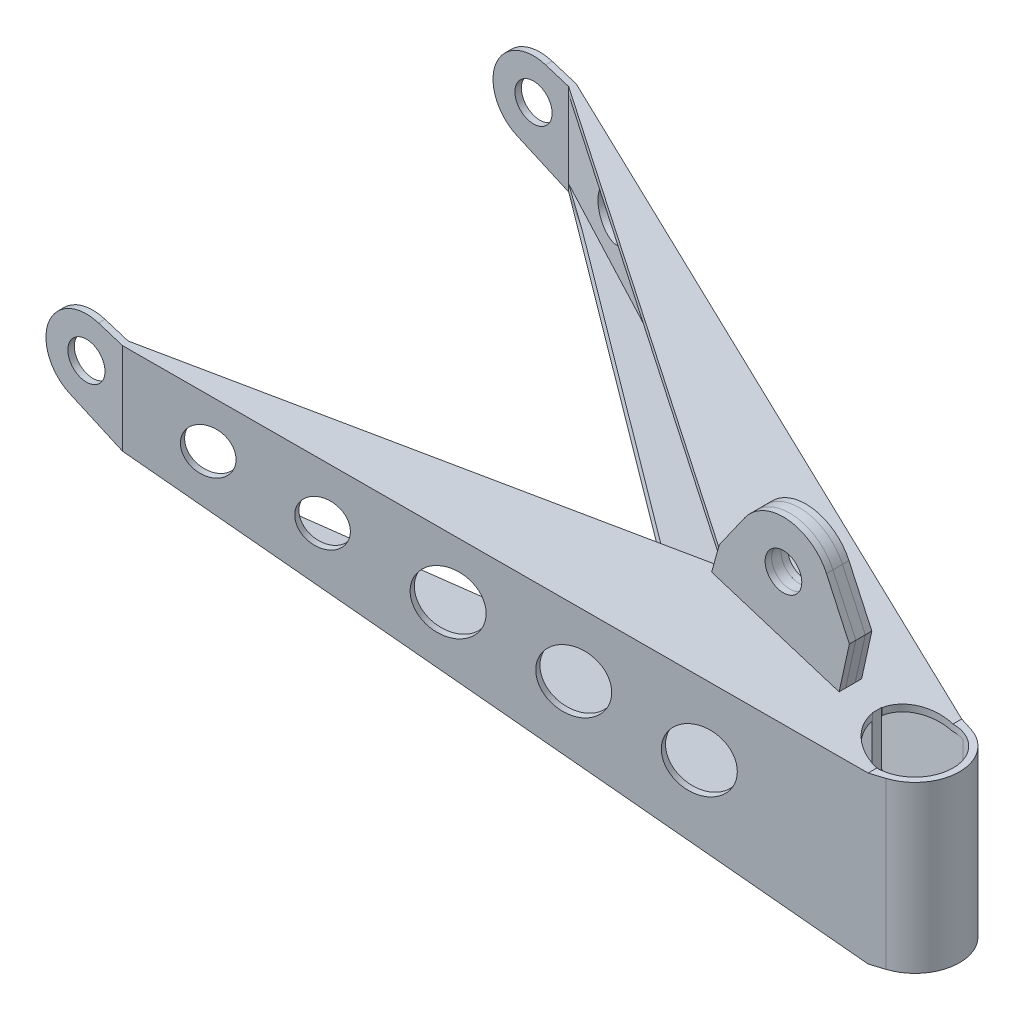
ISO-10303-21;
HEADER;
FILE_DESCRIPTION(('STEP AP214'),'2;1');
FILE_NAME('part.step','',(''),(''),'','','');
FILE_SCHEMA(('AUTOMOTIVE_DESIGN { 1 0 10303 214 1 1 1 1 }'));
ENDSEC;
DATA;
#1=APPLICATION_CONTEXT('core data for automotive mechanical design processes');
#2=APPLICATION_PROTOCOL_DEFINITION('international standard','automotive_design',2000,#1);
#3=PRODUCT_CONTEXT('',#1,'mechanical');
#4=PRODUCT('Part','Part','',(#3));
#5=PRODUCT_RELATED_PRODUCT_CATEGORY('part','',(#4));
#6=PRODUCT_DEFINITION_FORMATION('','',#4);
#7=PRODUCT_DEFINITION_CONTEXT('part definition',#1,'design');
#8=PRODUCT_DEFINITION('design','',#6,#7);
#9=PRODUCT_DEFINITION_SHAPE('','',#8);
#10=(LENGTH_UNIT() NAMED_UNIT(*) SI_UNIT(.MILLI.,.METRE.));
#11=(NAMED_UNIT(*) PLANE_ANGLE_UNIT() SI_UNIT($,.RADIAN.));
#12=(NAMED_UNIT(*) SI_UNIT($,.STERADIAN.) SOLID_ANGLE_UNIT());
#13=UNCERTAINTY_MEASURE_WITH_UNIT(LENGTH_MEASURE(1.E-05),#10,'distance_accuracy_value','');
#14=(GEOMETRIC_REPRESENTATION_CONTEXT(3) GLOBAL_UNCERTAINTY_ASSIGNED_CONTEXT((#13)) GLOBAL_UNIT_ASSIGNED_CONTEXT((#10,
#11,#12)) REPRESENTATION_CONTEXT('',''));
#15=CARTESIAN_POINT('',(0.,0.,0.));
#16=DIRECTION('',(0.,0.,1.));
#17=DIRECTION('',(1.,0.,0.));
#18=AXIS2_PLACEMENT_3D('',#15,#16,#17);
#19=CARTESIAN_POINT('',(-12.62,27.485,-1.18));
#20=DIRECTION('',(0.,0.,-1.));
#21=DIRECTION('',(-1.,0.,0.));
#22=AXIS2_PLACEMENT_3D('',#19,#20,#21);
#23=PLANE('',#22);
#24=DIRECTION('',(0.418948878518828,-0.908009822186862,0.));
#25=VECTOR('',#24,1.);
#26=CARTESIAN_POINT('',(-8.10265113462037,29.5692706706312,-1.18));
#27=LINE('',#26,#25);
#28=CARTESIAN_POINT('',(-8.10265113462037,29.5692706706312,-1.18));
#29=VERTEX_POINT('',#28);
#30=CARTESIAN_POINT('',(-5.70314316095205,24.3686915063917,-1.18));
#31=VERTEX_POINT('',#30);
#32=EDGE_CURVE('E141',#29,#31,#27,.T.);
#33=ORIENTED_EDGE('',*,*,#32,.T.);
#34=DIRECTION('',(-0.214933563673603,-0.976628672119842,0.));
#35=VECTOR('',#34,1.);
#36=CARTESIAN_POINT('',(-5.70314316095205,24.3686915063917,-1.18));
#37=LINE('',#36,#35);
#38=CARTESIAN_POINT('',(-6.77781097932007,19.4855481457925,-1.18));
#39=VERTEX_POINT('',#38);
#40=EDGE_CURVE('E99',#31,#39,#37,.T.);
#41=ORIENTED_EDGE('',*,*,#40,.T.);
#42=DIRECTION('',(-0.954179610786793,0.299234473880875,0.));
#43=VECTOR('',#42,1.);
#44=CARTESIAN_POINT('',(-6.77781097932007,19.4855481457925,-1.18));
#45=LINE('',#44,#43);
#46=CARTESIAN_POINT('',(-20.1569449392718,23.6812971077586,-1.18));
#47=VERTEX_POINT('',#46);
#48=EDGE_CURVE('E112',#39,#47,#45,.T.);
#49=ORIENTED_EDGE('',*,*,#48,.T.);
#50=DIRECTION('',(0.269342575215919,0.963044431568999,0.));
#51=VECTOR('',#50,1.);
#52=CARTESIAN_POINT('',(-20.1569449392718,23.6812971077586,-1.18));
#53=LINE('',#52,#51);
#54=CARTESIAN_POINT('',(-19.3485242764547,26.5718353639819,-1.18));
#55=VERTEX_POINT('',#54);
#56=EDGE_CURVE('E106',#47,#55,#53,.T.);
#57=ORIENTED_EDGE('',*,*,#56,.T.);
#58=DIRECTION('',(0.575866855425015,0.817543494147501,0.));
#59=VECTOR('',#58,1.);
#60=CARTESIAN_POINT('',(-19.3485242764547,26.5718353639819,-1.18));
#61=LINE('',#60,#59);
#62=CARTESIAN_POINT('',(-16.6872788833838,30.3499376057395,-1.18));
#63=VERTEX_POINT('',#62);
#64=EDGE_CURVE('E110',#55,#63,#61,.T.);
#65=ORIENTED_EDGE('',*,*,#64,.T.);
#66=CARTESIAN_POINT('',(-12.62,27.485,-1.18));
#67=DIRECTION('',(0.,0.,-1.));
#68=DIRECTION('',(-1.,0.,0.));
#69=AXIS2_PLACEMENT_3D('',#66,#67,#68);
#70=CIRCLE('',#69,4.975);
#71=EDGE_CURVE('E62',#63,#29,#70,.T.);
#72=ORIENTED_EDGE('',*,*,#71,.T.);
#73=EDGE_LOOP('',(#33,#41,#49,#57,#65,#72));
#74=FACE_BOUND('',#73,.T.);
#75=CARTESIAN_POINT('',(-12.62,27.485,-1.18));
#76=DIRECTION('',(0.,0.,-1.));
#77=DIRECTION('',(-1.,0.,0.));
#78=AXIS2_PLACEMENT_3D('',#75,#76,#77);
#79=CIRCLE('',#78,1.925);
#80=CARTESIAN_POINT('',(-14.545,27.485,-1.18));
#81=VERTEX_POINT('',#80);
#82=EDGE_CURVE('E134',#81,#81,#79,.T.);
#83=ORIENTED_EDGE('',*,*,#82,.F.);
#84=EDGE_LOOP('',(#83));
#85=FACE_BOUND('',#84,.T.);
#86=ADVANCED_FACE('F45',(#74,#85),#23,.T.);
#87=CARTESIAN_POINT('',(-12.62,27.485,-0.5));
#88=DIRECTION('',(0.,0.,-1.));
#89=DIRECTION('',(-1.,0.,0.));
#90=AXIS2_PLACEMENT_3D('',#87,#88,#89);
#91=PLANE('',#90);
#92=DIRECTION('',(0.418948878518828,-0.908009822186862,0.));
#93=VECTOR('',#92,1.);
#94=CARTESIAN_POINT('',(-8.10265113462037,29.5692706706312,-0.5));
#95=LINE('',#94,#93);
#96=CARTESIAN_POINT('',(-8.10265113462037,29.5692706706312,-0.5));
#97=VERTEX_POINT('',#96);
#98=CARTESIAN_POINT('',(-5.70314316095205,24.3686915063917,-0.5));
#99=VERTEX_POINT('',#98);
#100=EDGE_CURVE('E130',#97,#99,#95,.T.);
#101=ORIENTED_EDGE('',*,*,#100,.F.);
#102=CARTESIAN_POINT('',(-12.62,27.485,-0.5));
#103=DIRECTION('',(0.,0.,-1.));
#104=DIRECTION('',(-1.,0.,0.));
#105=AXIS2_PLACEMENT_3D('',#102,#103,#104);
#106=CIRCLE('',#105,4.975);
#107=CARTESIAN_POINT('',(-16.6872788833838,30.3499376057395,-0.5));
#108=VERTEX_POINT('',#107);
#109=EDGE_CURVE('E91',#108,#97,#106,.T.);
#110=ORIENTED_EDGE('',*,*,#109,.F.);
#111=DIRECTION('',(0.575866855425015,0.817543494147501,0.));
#112=VECTOR('',#111,1.);
#113=CARTESIAN_POINT('',(-19.3485242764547,26.5718353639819,-0.5));
#114=LINE('',#113,#112);
#115=CARTESIAN_POINT('',(-19.3485242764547,26.5718353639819,-0.5));
#116=VERTEX_POINT('',#115);
#117=EDGE_CURVE('E85',#116,#108,#114,.T.);
#118=ORIENTED_EDGE('',*,*,#117,.F.);
#119=DIRECTION('',(0.269342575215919,0.963044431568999,0.));
#120=VECTOR('',#119,1.);
#121=CARTESIAN_POINT('',(-20.1569449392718,23.6812971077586,-0.5));
#122=LINE('',#121,#120);
#123=CARTESIAN_POINT('',(-20.1569449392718,23.6812971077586,-0.5));
#124=VERTEX_POINT('',#123);
#125=EDGE_CURVE('E120',#124,#116,#122,.T.);
#126=ORIENTED_EDGE('',*,*,#125,.F.);
#127=DIRECTION('',(-0.954179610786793,0.299234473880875,0.));
#128=VECTOR('',#127,1.);
#129=CARTESIAN_POINT('',(-6.77781097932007,19.4855481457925,-0.5));
#130=LINE('',#129,#128);
#131=CARTESIAN_POINT('',(-6.77781097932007,19.4855481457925,-0.5));
#132=VERTEX_POINT('',#131);
#133=EDGE_CURVE('E136',#132,#124,#130,.T.);
#134=ORIENTED_EDGE('',*,*,#133,.F.);
#135=DIRECTION('',(-0.214933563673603,-0.976628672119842,0.));
#136=VECTOR('',#135,1.);
#137=CARTESIAN_POINT('',(-5.70314316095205,24.3686915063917,-0.5));
#138=LINE('',#137,#136);
#139=EDGE_CURVE('E133',#99,#132,#138,.T.);
#140=ORIENTED_EDGE('',*,*,#139,.F.);
#141=EDGE_LOOP('',(#101,#110,#118,#126,#134,#140));
#142=FACE_BOUND('',#141,.T.);
#143=CARTESIAN_POINT('',(-12.62,27.485,-0.5));
#144=DIRECTION('',(0.,0.,-1.));
#145=DIRECTION('',(-1.,0.,0.));
#146=AXIS2_PLACEMENT_3D('',#143,#144,#145);
#147=CIRCLE('',#146,1.925);
#148=CARTESIAN_POINT('',(-14.545,27.485,-0.5));
#149=VERTEX_POINT('',#148);
#150=EDGE_CURVE('E234',#149,#149,#147,.T.);
#151=ORIENTED_EDGE('',*,*,#150,.T.);
#152=EDGE_LOOP('',(#151));
#153=FACE_BOUND('',#152,.T.);
#154=ADVANCED_FACE('F150',(#142,#153),#91,.F.);
#155=CARTESIAN_POINT('',(-8.10265113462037,29.5692706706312,-1.18));
#156=DIRECTION('',(-0.908009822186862,-0.418948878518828,0.));
#157=DIRECTION('',(0.418948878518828,-0.908009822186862,0.));
#158=AXIS2_PLACEMENT_3D('',#155,#156,#157);
#159=PLANE('',#158);
#160=ORIENTED_EDGE('',*,*,#100,.T.);
#161=DIRECTION('',(0.,0.,1.));
#162=VECTOR('',#161,1.);
#163=CARTESIAN_POINT('',(-5.70314316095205,24.3686915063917,-1.18));
#164=LINE('',#163,#162);
#165=EDGE_CURVE('E12',#31,#99,#164,.T.);
#166=ORIENTED_EDGE('',*,*,#165,.F.);
#167=ORIENTED_EDGE('',*,*,#32,.F.);
#168=DIRECTION('',(0.,0.,1.));
#169=VECTOR('',#168,1.);
#170=CARTESIAN_POINT('',(-8.10265113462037,29.5692706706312,-1.18));
#171=LINE('',#170,#169);
#172=EDGE_CURVE('E126',#29,#97,#171,.T.);
#173=ORIENTED_EDGE('',*,*,#172,.T.);
#174=EDGE_LOOP('',(#160,#166,#167,#173));
#175=FACE_BOUND('',#174,.T.);
#176=ADVANCED_FACE('F47',(#175),#159,.F.);
#177=CARTESIAN_POINT('',(-5.70314316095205,24.3686915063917,-1.18));
#178=DIRECTION('',(-0.976628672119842,0.214933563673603,0.));
#179=DIRECTION('',(-0.214933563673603,-0.976628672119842,0.));
#180=AXIS2_PLACEMENT_3D('',#177,#178,#179);
#181=PLANE('',#180);
#182=ORIENTED_EDGE('',*,*,#139,.T.);
#183=DIRECTION('',(0.,0.,1.));
#184=VECTOR('',#183,1.);
#185=CARTESIAN_POINT('',(-6.77781097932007,19.4855481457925,-1.18));
#186=LINE('',#185,#184);
#187=EDGE_CURVE('E54',#39,#132,#186,.T.);
#188=ORIENTED_EDGE('',*,*,#187,.F.);
#189=ORIENTED_EDGE('',*,*,#40,.F.);
#190=ORIENTED_EDGE('',*,*,#165,.T.);
#191=EDGE_LOOP('',(#182,#188,#189,#190));
#192=FACE_BOUND('',#191,.T.);
#193=ADVANCED_FACE('F175',(#192),#181,.F.);
#194=CARTESIAN_POINT('',(-6.77781097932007,19.4855481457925,-1.18));
#195=DIRECTION('',(0.299234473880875,0.954179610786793,0.));
#196=DIRECTION('',(-0.954179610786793,0.299234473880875,0.));
#197=AXIS2_PLACEMENT_3D('',#194,#195,#196);
#198=PLANE('',#197);
#199=ORIENTED_EDGE('',*,*,#133,.T.);
#200=DIRECTION('',(0.,0.,1.));
#201=VECTOR('',#200,1.);
#202=CARTESIAN_POINT('',(-20.1569449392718,23.6812971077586,-1.18));
#203=LINE('',#202,#201);
#204=EDGE_CURVE('E121',#47,#124,#203,.T.);
#205=ORIENTED_EDGE('',*,*,#204,.F.);
#206=ORIENTED_EDGE('',*,*,#48,.F.);
#207=ORIENTED_EDGE('',*,*,#187,.T.);
#208=EDGE_LOOP('',(#199,#205,#206,#207));
#209=FACE_BOUND('',#208,.T.);
#210=ADVANCED_FACE('F147',(#209),#198,.F.);
#211=CARTESIAN_POINT('',(-20.1569449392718,23.6812971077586,-1.18));
#212=DIRECTION('',(0.963044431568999,-0.269342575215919,0.));
#213=DIRECTION('',(0.269342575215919,0.963044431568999,0.));
#214=AXIS2_PLACEMENT_3D('',#211,#212,#213);
#215=PLANE('',#214);
#216=ORIENTED_EDGE('',*,*,#125,.T.);
#217=DIRECTION('',(0.,0.,1.));
#218=VECTOR('',#217,1.);
#219=CARTESIAN_POINT('',(-19.3485242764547,26.5718353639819,-1.18));
#220=LINE('',#219,#218);
#221=EDGE_CURVE('E117',#55,#116,#220,.T.);
#222=ORIENTED_EDGE('',*,*,#221,.F.);
#223=ORIENTED_EDGE('',*,*,#56,.F.);
#224=ORIENTED_EDGE('',*,*,#204,.T.);
#225=EDGE_LOOP('',(#216,#222,#223,#224));
#226=FACE_BOUND('',#225,.T.);
#227=ADVANCED_FACE('F118',(#226),#215,.F.);
#228=CARTESIAN_POINT('',(-19.3485242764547,26.5718353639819,-1.18));
#229=DIRECTION('',(0.817543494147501,-0.575866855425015,0.));
#230=DIRECTION('',(0.575866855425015,0.817543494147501,0.));
#231=AXIS2_PLACEMENT_3D('',#228,#229,#230);
#232=PLANE('',#231);
#233=ORIENTED_EDGE('',*,*,#117,.T.);
#234=DIRECTION('',(0.,0.,1.));
#235=VECTOR('',#234,1.);
#236=CARTESIAN_POINT('',(-16.6872788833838,30.3499376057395,-1.18));
#237=LINE('',#236,#235);
#238=EDGE_CURVE('E122',#63,#108,#237,.T.);
#239=ORIENTED_EDGE('',*,*,#238,.F.);
#240=ORIENTED_EDGE('',*,*,#64,.F.);
#241=ORIENTED_EDGE('',*,*,#221,.T.);
#242=EDGE_LOOP('',(#233,#239,#240,#241));
#243=FACE_BOUND('',#242,.T.);
#244=ADVANCED_FACE('F124',(#243),#232,.F.);
#245=CARTESIAN_POINT('',(-12.62,27.485,-1.18));
#246=DIRECTION('',(0.,0.,1.));
#247=DIRECTION('',(1.,0.,0.));
#248=AXIS2_PLACEMENT_3D('',#245,#246,#247);
#249=CYLINDRICAL_SURFACE('',#248,4.975);
#250=ORIENTED_EDGE('',*,*,#109,.T.);
#251=ORIENTED_EDGE('',*,*,#172,.F.);
#252=ORIENTED_EDGE('',*,*,#71,.F.);
#253=ORIENTED_EDGE('',*,*,#238,.T.);
#254=EDGE_LOOP('',(#250,#251,#252,#253));
#255=FACE_BOUND('',#254,.T.);
#256=ADVANCED_FACE('F155',(#255),#249,.T.);
#257=CARTESIAN_POINT('',(-12.62,27.485,-1.18));
#258=DIRECTION('',(0.,0.,1.));
#259=DIRECTION('',(1.,0.,0.));
#260=AXIS2_PLACEMENT_3D('',#257,#258,#259);
#261=CYLINDRICAL_SURFACE('',#260,1.925);
#262=ORIENTED_EDGE('',*,*,#82,.T.);
#263=EDGE_LOOP('',(#262));
#264=FACE_BOUND('',#263,.T.);
#265=ORIENTED_EDGE('',*,*,#150,.F.);
#266=EDGE_LOOP('',(#265));
#267=FACE_BOUND('',#266,.T.);
#268=ADVANCED_FACE('F157',(#264,#267),#261,.F.);
#269=CLOSED_SHELL('',(#86,#154,#176,#193,#210,#227,#244,#256,#268));
#270=MANIFOLD_SOLID_BREP('B2',#269);
#271=CARTESIAN_POINT('',(-12.62,27.485,1.18));
#272=DIRECTION('',(0.,0.,1.));
#273=DIRECTION('',(1.,0.,0.));
#274=AXIS2_PLACEMENT_3D('',#271,#272,#273);
#275=PLANE('',#274);
#276=DIRECTION('',(-0.269342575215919,-0.963044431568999,0.));
#277=VECTOR('',#276,1.);
#278=CARTESIAN_POINT('',(-19.3485242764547,26.5718353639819,1.18));
#279=LINE('',#278,#277);
#280=CARTESIAN_POINT('',(-19.3485242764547,26.5718353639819,1.18));
#281=VERTEX_POINT('',#280);
#282=CARTESIAN_POINT('',(-20.1569449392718,23.6812971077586,1.18));
#283=VERTEX_POINT('',#282);
#284=EDGE_CURVE('E346',#281,#283,#279,.T.);
#285=ORIENTED_EDGE('',*,*,#284,.T.);
#286=DIRECTION('',(0.954179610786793,-0.299234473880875,0.));
#287=VECTOR('',#286,1.);
#288=CARTESIAN_POINT('',(-20.1569449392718,23.6812971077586,1.18));
#289=LINE('',#288,#287);
#290=CARTESIAN_POINT('',(-6.77781097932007,19.4855481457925,1.18));
#291=VERTEX_POINT('',#290);
#292=EDGE_CURVE('E304',#283,#291,#289,.T.);
#293=ORIENTED_EDGE('',*,*,#292,.T.);
#294=DIRECTION('',(0.214933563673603,0.976628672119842,0.));
#295=VECTOR('',#294,1.);
#296=CARTESIAN_POINT('',(-6.77781097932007,19.4855481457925,1.18));
#297=LINE('',#296,#295);
#298=CARTESIAN_POINT('',(-5.70314316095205,24.3686915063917,1.18));
#299=VERTEX_POINT('',#298);
#300=EDGE_CURVE('E317',#291,#299,#297,.T.);
#301=ORIENTED_EDGE('',*,*,#300,.T.);
#302=DIRECTION('',(-0.418948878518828,0.908009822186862,0.));
#303=VECTOR('',#302,1.);
#304=CARTESIAN_POINT('',(-5.70314316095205,24.3686915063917,1.18));
#305=LINE('',#304,#303);
#306=CARTESIAN_POINT('',(-8.10265113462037,29.5692706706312,1.18));
#307=VERTEX_POINT('',#306);
#308=EDGE_CURVE('E311',#299,#307,#305,.T.);
#309=ORIENTED_EDGE('',*,*,#308,.T.);
#310=CARTESIAN_POINT('',(-12.62,27.485,1.18));
#311=DIRECTION('',(0.,0.,1.));
#312=DIRECTION('',(1.,0.,0.));
#313=AXIS2_PLACEMENT_3D('',#310,#311,#312);
#314=CIRCLE('',#313,4.975);
#315=CARTESIAN_POINT('',(-16.6872788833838,30.3499376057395,1.18));
#316=VERTEX_POINT('',#315);
#317=EDGE_CURVE('E315',#307,#316,#314,.T.);
#318=ORIENTED_EDGE('',*,*,#317,.T.);
#319=DIRECTION('',(-0.575866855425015,-0.817543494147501,0.));
#320=VECTOR('',#319,1.);
#321=CARTESIAN_POINT('',(-16.6872788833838,30.3499376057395,1.18));
#322=LINE('',#321,#320);
#323=EDGE_CURVE('E267',#316,#281,#322,.T.);
#324=ORIENTED_EDGE('',*,*,#323,.T.);
#325=EDGE_LOOP('',(#285,#293,#301,#309,#318,#324));
#326=FACE_BOUND('',#325,.T.);
#327=CARTESIAN_POINT('',(-12.62,27.485,1.18));
#328=DIRECTION('',(0.,0.,1.));
#329=DIRECTION('',(1.,0.,0.));
#330=AXIS2_PLACEMENT_3D('',#327,#328,#329);
#331=CIRCLE('',#330,1.925);
#332=CARTESIAN_POINT('',(-10.695,27.485,1.18));
#333=VERTEX_POINT('',#332);
#334=EDGE_CURVE('E339',#333,#333,#331,.T.);
#335=ORIENTED_EDGE('',*,*,#334,.F.);
#336=EDGE_LOOP('',(#335));
#337=FACE_BOUND('',#336,.T.);
#338=ADVANCED_FACE('F250',(#326,#337),#275,.T.);
#339=CARTESIAN_POINT('',(-12.62,27.485,0.5));
#340=DIRECTION('',(0.,0.,1.));
#341=DIRECTION('',(1.,0.,0.));
#342=AXIS2_PLACEMENT_3D('',#339,#340,#341);
#343=PLANE('',#342);
#344=DIRECTION('',(-0.269342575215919,-0.963044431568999,0.));
#345=VECTOR('',#344,1.);
#346=CARTESIAN_POINT('',(-19.3485242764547,26.5718353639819,0.5));
#347=LINE('',#346,#345);
#348=CARTESIAN_POINT('',(-19.3485242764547,26.5718353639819,0.5));
#349=VERTEX_POINT('',#348);
#350=CARTESIAN_POINT('',(-20.1569449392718,23.6812971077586,0.5));
#351=VERTEX_POINT('',#350);
#352=EDGE_CURVE('E335',#349,#351,#347,.T.);
#353=ORIENTED_EDGE('',*,*,#352,.F.);
#354=DIRECTION('',(-0.575866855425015,-0.817543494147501,0.));
#355=VECTOR('',#354,1.);
#356=CARTESIAN_POINT('',(-16.6872788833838,30.3499376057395,0.5));
#357=LINE('',#356,#355);
#358=CARTESIAN_POINT('',(-16.6872788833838,30.3499376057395,0.5));
#359=VERTEX_POINT('',#358);
#360=EDGE_CURVE('E296',#359,#349,#357,.T.);
#361=ORIENTED_EDGE('',*,*,#360,.F.);
#362=CARTESIAN_POINT('',(-12.62,27.485,0.5));
#363=DIRECTION('',(0.,0.,1.));
#364=DIRECTION('',(1.,0.,0.));
#365=AXIS2_PLACEMENT_3D('',#362,#363,#364);
#366=CIRCLE('',#365,4.975);
#367=CARTESIAN_POINT('',(-8.10265113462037,29.5692706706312,0.5));
#368=VERTEX_POINT('',#367);
#369=EDGE_CURVE('E290',#368,#359,#366,.T.);
#370=ORIENTED_EDGE('',*,*,#369,.F.);
#371=DIRECTION('',(-0.418948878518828,0.908009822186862,0.));
#372=VECTOR('',#371,1.);
#373=CARTESIAN_POINT('',(-5.70314316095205,24.3686915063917,0.5));
#374=LINE('',#373,#372);
#375=CARTESIAN_POINT('',(-5.70314316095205,24.3686915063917,0.5));
#376=VERTEX_POINT('',#375);
#377=EDGE_CURVE('E325',#376,#368,#374,.T.);
#378=ORIENTED_EDGE('',*,*,#377,.F.);
#379=DIRECTION('',(0.214933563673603,0.976628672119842,0.));
#380=VECTOR('',#379,1.);
#381=CARTESIAN_POINT('',(-6.77781097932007,19.4855481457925,0.5));
#382=LINE('',#381,#380);
#383=CARTESIAN_POINT('',(-6.77781097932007,19.4855481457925,0.5));
#384=VERTEX_POINT('',#383);
#385=EDGE_CURVE('E341',#384,#376,#382,.T.);
#386=ORIENTED_EDGE('',*,*,#385,.F.);
#387=DIRECTION('',(0.954179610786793,-0.299234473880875,0.));
#388=VECTOR('',#387,1.);
#389=CARTESIAN_POINT('',(-20.1569449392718,23.6812971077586,0.5));
#390=LINE('',#389,#388);
#391=EDGE_CURVE('E338',#351,#384,#390,.T.);
#392=ORIENTED_EDGE('',*,*,#391,.F.);
#393=EDGE_LOOP('',(#353,#361,#370,#378,#386,#392));
#394=FACE_BOUND('',#393,.T.);
#395=CARTESIAN_POINT('',(-12.62,27.485,0.5));
#396=DIRECTION('',(0.,0.,1.));
#397=DIRECTION('',(1.,0.,0.));
#398=AXIS2_PLACEMENT_3D('',#395,#396,#397);
#399=CIRCLE('',#398,1.925);
#400=CARTESIAN_POINT('',(-10.695,27.485,0.5));
#401=VERTEX_POINT('',#400);
#402=EDGE_CURVE('E439',#401,#401,#399,.T.);
#403=ORIENTED_EDGE('',*,*,#402,.T.);
#404=EDGE_LOOP('',(#403));
#405=FACE_BOUND('',#404,.T.);
#406=ADVANCED_FACE('F355',(#394,#405),#343,.F.);
#407=CARTESIAN_POINT('',(-19.3485242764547,26.5718353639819,1.18));
#408=DIRECTION('',(0.963044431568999,-0.269342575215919,0.));
#409=DIRECTION('',(0.269342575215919,0.963044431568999,0.));
#410=AXIS2_PLACEMENT_3D('',#407,#408,#409);
#411=PLANE('',#410);
#412=ORIENTED_EDGE('',*,*,#352,.T.);
#413=DIRECTION('',(0.,0.,-1.));
#414=VECTOR('',#413,1.);
#415=CARTESIAN_POINT('',(-20.1569449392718,23.6812971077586,1.18));
#416=LINE('',#415,#414);
#417=EDGE_CURVE('E43',#283,#351,#416,.T.);
#418=ORIENTED_EDGE('',*,*,#417,.F.);
#419=ORIENTED_EDGE('',*,*,#284,.F.);
#420=DIRECTION('',(0.,0.,-1.));
#421=VECTOR('',#420,1.);
#422=CARTESIAN_POINT('',(-19.3485242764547,26.5718353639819,1.18));
#423=LINE('',#422,#421);
#424=EDGE_CURVE('E331',#281,#349,#423,.T.);
#425=ORIENTED_EDGE('',*,*,#424,.T.);
#426=EDGE_LOOP('',(#412,#418,#419,#425));
#427=FACE_BOUND('',#426,.T.);
#428=ADVANCED_FACE('F252',(#427),#411,.F.);
#429=CARTESIAN_POINT('',(-20.1569449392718,23.6812971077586,1.18));
#430=DIRECTION('',(0.299234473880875,0.954179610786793,0.));
#431=DIRECTION('',(-0.954179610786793,0.299234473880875,0.));
#432=AXIS2_PLACEMENT_3D('',#429,#430,#431);
#433=PLANE('',#432);
#434=ORIENTED_EDGE('',*,*,#391,.T.);
#435=DIRECTION('',(0.,0.,-1.));
#436=VECTOR('',#435,1.);
#437=CARTESIAN_POINT('',(-6.77781097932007,19.4855481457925,1.18));
#438=LINE('',#437,#436);
#439=EDGE_CURVE('E259',#291,#384,#438,.T.);
#440=ORIENTED_EDGE('',*,*,#439,.F.);
#441=ORIENTED_EDGE('',*,*,#292,.F.);
#442=ORIENTED_EDGE('',*,*,#417,.T.);
#443=EDGE_LOOP('',(#434,#440,#441,#442));
#444=FACE_BOUND('',#443,.T.);
#445=ADVANCED_FACE('F380',(#444),#433,.F.);
#446=CARTESIAN_POINT('',(-6.77781097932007,19.4855481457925,1.18));
#447=DIRECTION('',(-0.976628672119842,0.214933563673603,0.));
#448=DIRECTION('',(-0.214933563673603,-0.976628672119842,0.));
#449=AXIS2_PLACEMENT_3D('',#446,#447,#448);
#450=PLANE('',#449);
#451=ORIENTED_EDGE('',*,*,#385,.T.);
#452=DIRECTION('',(0.,0.,-1.));
#453=VECTOR('',#452,1.);
#454=CARTESIAN_POINT('',(-5.70314316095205,24.3686915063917,1.18));
#455=LINE('',#454,#453);
#456=EDGE_CURVE('E326',#299,#376,#455,.T.);
#457=ORIENTED_EDGE('',*,*,#456,.F.);
#458=ORIENTED_EDGE('',*,*,#300,.F.);
#459=ORIENTED_EDGE('',*,*,#439,.T.);
#460=EDGE_LOOP('',(#451,#457,#458,#459));
#461=FACE_BOUND('',#460,.T.);
#462=ADVANCED_FACE('F352',(#461),#450,.F.);
#463=CARTESIAN_POINT('',(-5.70314316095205,24.3686915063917,1.18));
#464=DIRECTION('',(-0.908009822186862,-0.418948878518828,0.));
#465=DIRECTION('',(0.418948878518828,-0.908009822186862,0.));
#466=AXIS2_PLACEMENT_3D('',#463,#464,#465);
#467=PLANE('',#466);
#468=ORIENTED_EDGE('',*,*,#377,.T.);
#469=DIRECTION('',(0.,0.,-1.));
#470=VECTOR('',#469,1.);
#471=CARTESIAN_POINT('',(-8.10265113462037,29.5692706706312,1.18));
#472=LINE('',#471,#470);
#473=EDGE_CURVE('E322',#307,#368,#472,.T.);
#474=ORIENTED_EDGE('',*,*,#473,.F.);
#475=ORIENTED_EDGE('',*,*,#308,.F.);
#476=ORIENTED_EDGE('',*,*,#456,.T.);
#477=EDGE_LOOP('',(#468,#474,#475,#476));
#478=FACE_BOUND('',#477,.T.);
#479=ADVANCED_FACE('F323',(#478),#467,.F.);
#480=CARTESIAN_POINT('',(-12.62,27.485,1.18));
#481=DIRECTION('',(0.,0.,-1.));
#482=DIRECTION('',(-1.,0.,0.));
#483=AXIS2_PLACEMENT_3D('',#480,#481,#482);
#484=CYLINDRICAL_SURFACE('',#483,4.975);
#485=ORIENTED_EDGE('',*,*,#369,.T.);
#486=DIRECTION('',(0.,0.,-1.));
#487=VECTOR('',#486,1.);
#488=CARTESIAN_POINT('',(-16.6872788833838,30.3499376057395,1.18));
#489=LINE('',#488,#487);
#490=EDGE_CURVE('E327',#316,#359,#489,.T.);
#491=ORIENTED_EDGE('',*,*,#490,.F.);
#492=ORIENTED_EDGE('',*,*,#317,.F.);
#493=ORIENTED_EDGE('',*,*,#473,.T.);
#494=EDGE_LOOP('',(#485,#491,#492,#493));
#495=FACE_BOUND('',#494,.T.);
#496=ADVANCED_FACE('F329',(#495),#484,.T.);
#497=CARTESIAN_POINT('',(-16.6872788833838,30.3499376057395,1.18));
#498=DIRECTION('',(0.817543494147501,-0.575866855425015,0.));
#499=DIRECTION('',(0.575866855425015,0.817543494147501,0.));
#500=AXIS2_PLACEMENT_3D('',#497,#498,#499);
#501=PLANE('',#500);
#502=ORIENTED_EDGE('',*,*,#360,.T.);
#503=ORIENTED_EDGE('',*,*,#424,.F.);
#504=ORIENTED_EDGE('',*,*,#323,.F.);
#505=ORIENTED_EDGE('',*,*,#490,.T.);
#506=EDGE_LOOP('',(#502,#503,#504,#505));
#507=FACE_BOUND('',#506,.T.);
#508=ADVANCED_FACE('F360',(#507),#501,.F.);
#509=CARTESIAN_POINT('',(-12.62,27.485,1.18));
#510=DIRECTION('',(0.,0.,-1.));
#511=DIRECTION('',(-1.,0.,0.));
#512=AXIS2_PLACEMENT_3D('',#509,#510,#511);
#513=CYLINDRICAL_SURFACE('',#512,1.925);
#514=ORIENTED_EDGE('',*,*,#334,.T.);
#515=EDGE_LOOP('',(#514));
#516=FACE_BOUND('',#515,.T.);
#517=ORIENTED_EDGE('',*,*,#402,.F.);
#518=EDGE_LOOP('',(#517));
#519=FACE_BOUND('',#518,.T.);
#520=ADVANCED_FACE('F362',(#516,#519),#513,.F.);
#521=CLOSED_SHELL('',(#338,#406,#428,#445,#462,#479,#496,#508,#520));
#522=MANIFOLD_SOLID_BREP('B6',#521);
#523=CARTESIAN_POINT('',(-20.72,40.,-0.499999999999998));
#524=DIRECTION('',(0.,0.,-1.));
#525=DIRECTION('',(-1.,0.,0.));
#526=AXIS2_PLACEMENT_3D('',#523,#524,#525);
#527=PLANE('',#526);
#528=DIRECTION('',(0.,1.,0.));
#529=VECTOR('',#528,1.);
#530=CARTESIAN_POINT('',(-4.,1.77731435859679,-0.5));
#531=LINE('',#530,#529);
#532=CARTESIAN_POINT('',(-4.,17.9017616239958,-0.5));
#533=VERTEX_POINT('',#532);
#534=CARTESIAN_POINT('',(-4.,18.6144157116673,-0.5));
#535=VERTEX_POINT('',#534);
#536=EDGE_CURVE('E760',#533,#535,#531,.T.);
#537=ORIENTED_EDGE('',*,*,#536,.F.);
#538=DIRECTION('',(-0.954179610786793,0.299234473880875,0.));
#539=VECTOR('',#538,1.);
#540=CARTESIAN_POINT('',(-25.5324348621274,24.6544177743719,-0.499999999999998));
#541=LINE('',#540,#539);
#542=CARTESIAN_POINT('',(-3.96862696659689,17.8919229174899,-0.499999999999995));
#543=VERTEX_POINT('',#542);
#544=EDGE_CURVE('E949',#543,#533,#541,.T.);
#545=ORIENTED_EDGE('',*,*,#544,.F.);
#546=DIRECTION('',(0.,-1.,0.));
#547=VECTOR('',#546,1.);
#548=CARTESIAN_POINT('',(-3.96862696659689,40.,-0.499999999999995));
#549=LINE('',#548,#547);
#550=CARTESIAN_POINT('',(-3.96862696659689,18.6045770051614,-0.499999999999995));
#551=VERTEX_POINT('',#550);
#552=EDGE_CURVE('E1101',#551,#543,#549,.T.);
#553=ORIENTED_EDGE('',*,*,#552,.F.);
#554=DIRECTION('',(-0.954179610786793,0.299234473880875,0.));
#555=VECTOR('',#554,1.);
#556=CARTESIAN_POINT('',(-25.3289554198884,25.3032599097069,-0.499999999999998));
#557=LINE('',#556,#555);
#558=EDGE_CURVE('E1043',#551,#535,#557,.T.);
#559=ORIENTED_EDGE('',*,*,#558,.T.);
#560=EDGE_LOOP('',(#537,#545,#553,#559));
#561=FACE_BOUND('',#560,.T.);
#562=ADVANCED_FACE('F446',(#561),#527,.F.);
#563=DIRECTION('',(-0.269342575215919,-0.963044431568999,0.));
#564=VECTOR('',#563,1.);
#565=CARTESIAN_POINT('',(-23.82,10.5839070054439,-0.5));
#566=LINE('',#565,#564);
#567=CARTESIAN_POINT('',(-20.1569449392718,23.6812971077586,-0.5));
#568=VERTEX_POINT('',#567);
#569=CARTESIAN_POINT('',(-20.340186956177,23.026108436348,-0.499999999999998));
#570=VERTEX_POINT('',#569);
#571=EDGE_CURVE('E780',#568,#570,#566,.T.);
#572=ORIENTED_EDGE('',*,*,#571,.F.);
#573=CARTESIAN_POINT('',(-20.72,23.8578733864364,-0.499999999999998));
#574=VERTEX_POINT('',#573);
#575=EDGE_CURVE('E1047',#568,#574,#557,.T.);
#576=ORIENTED_EDGE('',*,*,#575,.T.);
#577=DIRECTION('',(0.,-1.,0.));
#578=VECTOR('',#577,1.);
#579=CARTESIAN_POINT('',(-20.72,40.,-0.499999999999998));
#580=LINE('',#579,#578);
#581=CARTESIAN_POINT('',(-20.72,23.1452192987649,-0.499999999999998));
#582=VERTEX_POINT('',#581);
#583=EDGE_CURVE('E1104',#574,#582,#580,.T.);
#584=ORIENTED_EDGE('',*,*,#583,.T.);
#585=EDGE_CURVE('E948',#570,#582,#541,.T.);
#586=ORIENTED_EDGE('',*,*,#585,.F.);
#587=EDGE_LOOP('',(#572,#576,#584,#586));
#588=FACE_BOUND('',#587,.T.);
#589=ADVANCED_FACE('F1243',(#588),#527,.F.);
#590=CARTESIAN_POINT('',(-4.,1.77731435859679,-0.5));
#591=VERTEX_POINT('',#590);
#592=CARTESIAN_POINT('',(-3.99999999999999,2.5214182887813,-0.499999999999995));
#593=VERTEX_POINT('',#592);
#594=EDGE_CURVE('E761',#591,#593,#531,.T.);
#595=ORIENTED_EDGE('',*,*,#594,.F.);
#596=DIRECTION('',(0.91385083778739,-0.406050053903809,0.));
#597=VECTOR('',#596,1.);
#598=CARTESIAN_POINT('',(-32.1465231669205,14.283619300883,-0.499999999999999));
#599=LINE('',#598,#597);
#600=CARTESIAN_POINT('',(-3.96862696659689,1.76337442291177,-0.499999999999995));
#601=VERTEX_POINT('',#600);
#602=EDGE_CURVE('E1021',#591,#601,#599,.T.);
#603=ORIENTED_EDGE('',*,*,#602,.T.);
#604=CARTESIAN_POINT('',(-3.96862696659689,2.50747835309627,-0.499999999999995));
#605=VERTEX_POINT('',#604);
#606=EDGE_CURVE('E1100',#605,#601,#549,.T.);
#607=ORIENTED_EDGE('',*,*,#606,.F.);
#608=DIRECTION('',(0.91385083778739,-0.406050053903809,0.));
#609=VECTOR('',#608,1.);
#610=CARTESIAN_POINT('',(-31.8704091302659,14.9050378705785,-0.499999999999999));
#611=LINE('',#610,#609);
#612=EDGE_CURVE('E729',#593,#605,#611,.T.);
#613=ORIENTED_EDGE('',*,*,#612,.F.);
#614=EDGE_LOOP('',(#595,#603,#607,#613));
#615=FACE_BOUND('',#614,.T.);
#616=ADVANCED_FACE('F1241',(#615),#527,.F.);
#617=CARTESIAN_POINT('',(-20.72,40.,0.500000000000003));
#618=DIRECTION('',(0.,0.,1.));
#619=DIRECTION('',(1.,0.,0.));
#620=AXIS2_PLACEMENT_3D('',#617,#618,#619);
#621=PLANE('',#620);
#622=DIRECTION('',(0.,1.,0.));
#623=VECTOR('',#622,1.);
#624=CARTESIAN_POINT('',(-4.,1.77731435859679,0.5));
#625=LINE('',#624,#623);
#626=CARTESIAN_POINT('',(-4.,17.9017616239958,0.500000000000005));
#627=VERTEX_POINT('',#626);
#628=CARTESIAN_POINT('',(-4.,18.6144157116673,0.5));
#629=VERTEX_POINT('',#628);
#630=EDGE_CURVE('E783',#627,#629,#625,.T.);
#631=ORIENTED_EDGE('',*,*,#630,.T.);
#632=DIRECTION('',(0.954179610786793,-0.299234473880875,0.));
#633=VECTOR('',#632,1.);
#634=CARTESIAN_POINT('',(-25.3289554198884,25.3032599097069,0.500000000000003));
#635=LINE('',#634,#633);
#636=CARTESIAN_POINT('',(-3.96862696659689,18.6045770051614,0.500000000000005));
#637=VERTEX_POINT('',#636);
#638=EDGE_CURVE('E1035',#629,#637,#635,.T.);
#639=ORIENTED_EDGE('',*,*,#638,.T.);
#640=DIRECTION('',(0.,-1.,0.));
#641=VECTOR('',#640,1.);
#642=CARTESIAN_POINT('',(-3.96862696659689,40.,0.500000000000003));
#643=LINE('',#642,#641);
#644=CARTESIAN_POINT('',(-3.96862696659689,17.8919229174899,0.500000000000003));
#645=VERTEX_POINT('',#644);
#646=EDGE_CURVE('E1097',#637,#645,#643,.T.);
#647=ORIENTED_EDGE('',*,*,#646,.T.);
#648=DIRECTION('',(0.954179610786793,-0.299234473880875,0.));
#649=VECTOR('',#648,1.);
#650=CARTESIAN_POINT('',(-25.5324348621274,24.6544177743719,0.500000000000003));
#651=LINE('',#650,#649);
#652=EDGE_CURVE('E935',#627,#645,#651,.T.);
#653=ORIENTED_EDGE('',*,*,#652,.F.);
#654=EDGE_LOOP('',(#631,#639,#647,#653));
#655=FACE_BOUND('',#654,.T.);
#656=ADVANCED_FACE('F1189',(#655),#621,.F.);
#657=DIRECTION('',(-0.269342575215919,-0.963044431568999,0.));
#658=VECTOR('',#657,1.);
#659=CARTESIAN_POINT('',(-23.82,10.5839070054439,0.5));
#660=LINE('',#659,#658);
#661=CARTESIAN_POINT('',(-20.1569449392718,23.6812971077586,0.5));
#662=VERTEX_POINT('',#661);
#663=CARTESIAN_POINT('',(-20.340186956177,23.026108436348,0.5));
#664=VERTEX_POINT('',#663);
#665=EDGE_CURVE('E801',#662,#664,#660,.T.);
#666=ORIENTED_EDGE('',*,*,#665,.T.);
#667=CARTESIAN_POINT('',(-20.72,23.1452192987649,0.500000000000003));
#668=VERTEX_POINT('',#667);
#669=EDGE_CURVE('E936',#668,#664,#651,.T.);
#670=ORIENTED_EDGE('',*,*,#669,.F.);
#671=DIRECTION('',(0.,-1.,0.));
#672=VECTOR('',#671,1.);
#673=CARTESIAN_POINT('',(-20.72,40.,0.500000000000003));
#674=LINE('',#673,#672);
#675=CARTESIAN_POINT('',(-20.72,23.8578733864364,0.500000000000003));
#676=VERTEX_POINT('',#675);
#677=EDGE_CURVE('E1093',#676,#668,#674,.T.);
#678=ORIENTED_EDGE('',*,*,#677,.F.);
#679=EDGE_CURVE('E1036',#676,#662,#635,.T.);
#680=ORIENTED_EDGE('',*,*,#679,.T.);
#681=EDGE_LOOP('',(#666,#670,#678,#680));
#682=FACE_BOUND('',#681,.T.);
#683=ADVANCED_FACE('F1209',(#682),#621,.F.);
#684=CARTESIAN_POINT('',(-4.,1.77731435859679,0.5));
#685=VERTEX_POINT('',#684);
#686=CARTESIAN_POINT('',(-4.,2.5214182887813,0.5));
#687=VERTEX_POINT('',#686);
#688=EDGE_CURVE('E784',#685,#687,#625,.T.);
#689=ORIENTED_EDGE('',*,*,#688,.T.);
#690=DIRECTION('',(-0.91385083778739,0.406050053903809,0.));
#691=VECTOR('',#690,1.);
#692=CARTESIAN_POINT('',(-31.8704091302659,14.9050378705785,0.500000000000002));
#693=LINE('',#692,#691);
#694=CARTESIAN_POINT('',(-3.96862696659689,2.50747835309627,0.500000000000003));
#695=VERTEX_POINT('',#694);
#696=EDGE_CURVE('E962',#695,#687,#693,.T.);
#697=ORIENTED_EDGE('',*,*,#696,.F.);
#698=CARTESIAN_POINT('',(-3.96862696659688,1.76337442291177,0.500000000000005));
#699=VERTEX_POINT('',#698);
#700=EDGE_CURVE('E1096',#695,#699,#643,.T.);
#701=ORIENTED_EDGE('',*,*,#700,.T.);
#702=DIRECTION('',(-0.91385083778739,0.406050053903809,0.));
#703=VECTOR('',#702,1.);
#704=CARTESIAN_POINT('',(-32.1465231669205,14.283619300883,0.500000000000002));
#705=LINE('',#704,#703);
#706=EDGE_CURVE('E1014',#699,#685,#705,.T.);
#707=ORIENTED_EDGE('',*,*,#706,.T.);
#708=EDGE_LOOP('',(#689,#697,#701,#707));
#709=FACE_BOUND('',#708,.T.);
#710=ADVANCED_FACE('F1177',(#709),#621,.F.);
#711=CARTESIAN_POINT('',(-59.4555987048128,40.,-23.12));
#712=DIRECTION('',(0.504274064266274,0.,-0.863543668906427));
#713=DIRECTION('',(-0.863543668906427,0.,-0.504274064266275));
#714=AXIS2_PLACEMENT_3D('',#711,#712,#713);
#715=PLANE('',#714);
#716=DIRECTION('',(0.,-1.,0.));
#717=VECTOR('',#716,1.);
#718=CARTESIAN_POINT('',(-59.4555987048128,40.,-23.12));
#719=LINE('',#718,#717);
#720=CARTESIAN_POINT('',(-59.4555987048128,27.1619262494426,-23.12));
#721=VERTEX_POINT('',#720);
#722=CARTESIAN_POINT('',(-59.4555987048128,26.4178223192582,-23.12));
#723=VERTEX_POINT('',#722);
#724=EDGE_CURVE('E1107',#721,#723,#719,.T.);
#725=ORIENTED_EDGE('',*,*,#724,.T.);
#726=DIRECTION('',(0.84718652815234,-0.193713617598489,0.494722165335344));
#727=VECTOR('',#726,1.);
#728=CARTESIAN_POINT('',(-61.6845911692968,26.9274930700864,-24.421640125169));
#729=LINE('',#728,#727);
#730=CARTESIAN_POINT('',(-56.0054559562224,25.6289291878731,-21.1052582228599));
#731=VERTEX_POINT('',#730);
#732=EDGE_CURVE('E737',#723,#731,#729,.T.);
#733=ORIENTED_EDGE('',*,*,#732,.T.);
#734=DIRECTION('',(0.806232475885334,-0.358232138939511,0.470806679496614));
#735=VECTOR('',#734,1.);
#736=CARTESIAN_POINT('',(-63.1634704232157,28.8094396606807,-25.2852449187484));
#737=LINE('',#736,#735);
#738=EDGE_CURVE('E728',#721,#731,#737,.T.);
#739=ORIENTED_EDGE('',*,*,#738,.F.);
#740=EDGE_LOOP('',(#725,#733,#739));
#741=FACE_BOUND('',#740,.T.);
#742=ADVANCED_FACE('F1287',(#741),#715,.F.);
#743=DIRECTION('',(-0.833519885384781,0.26139511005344,-0.486741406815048));
#744=VECTOR('',#743,1.);
#745=CARTESIAN_POINT('',(-60.4811821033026,35.6144821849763,-23.7188986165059));
#746=LINE('',#745,#744);
#747=CARTESIAN_POINT('',(-59.4555987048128,35.2928552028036,-23.12));
#748=VERTEX_POINT('',#747);
#749=EDGE_CURVE('E916',#582,#748,#746,.T.);
#750=ORIENTED_EDGE('',*,*,#749,.F.);
#751=ORIENTED_EDGE('',*,*,#583,.F.);
#752=DIRECTION('',(-0.833519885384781,0.26139511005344,-0.486741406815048));
#753=VECTOR('',#752,1.);
#754=CARTESIAN_POINT('',(-60.3259104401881,36.2784424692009,-23.628226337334));
#755=LINE('',#754,#753);
#756=CARTESIAN_POINT('',(-59.4555987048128,36.0055092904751,-23.12));
#757=VERTEX_POINT('',#756);
#758=EDGE_CURVE('E1046',#574,#757,#755,.T.);
#759=ORIENTED_EDGE('',*,*,#758,.T.);
#760=EDGE_CURVE('E1108',#757,#748,#719,.T.);
#761=ORIENTED_EDGE('',*,*,#760,.T.);
#762=EDGE_LOOP('',(#750,#751,#759,#761));
#763=FACE_BOUND('',#762,.T.);
#764=ADVANCED_FACE('F1418',(#763),#715,.F.);
#765=CARTESIAN_POINT('',(0.,40.,0.));
#766=DIRECTION('',(0.,-1.,0.));
#767=DIRECTION('',(0.,0.,-1.));
#768=AXIS2_PLACEMENT_3D('',#765,#766,#767);
#769=CYLINDRICAL_SURFACE('',#768,4.);
#770=CARTESIAN_POINT('',(0.,0.744103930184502,0.));
#771=DIRECTION('',(0.406050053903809,0.91385083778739,0.));
#772=DIRECTION('',(0.91385083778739,-0.406050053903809,0.));
#773=AXIS2_PLACEMENT_3D('',#770,#771,#772);
#774=ELLIPSE('',#773,4.3770819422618,4.);
#775=CARTESIAN_POINT('',(0.144271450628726,0.68,3.99739737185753));
#776=VERTEX_POINT('',#775);
#777=EDGE_CURVE('E958',#776,#695,#774,.F.);
#778=ORIENTED_EDGE('',*,*,#777,.F.);
#779=CARTESIAN_POINT('',(0.,0.68,0.));
#780=DIRECTION('',(0.,1.,0.));
#781=DIRECTION('',(0.,0.,1.));
#782=AXIS2_PLACEMENT_3D('',#779,#780,#781);
#783=CIRCLE('',#782,4.);
#784=CARTESIAN_POINT('',(1.21308338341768,0.68,3.81161759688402));
#785=VERTEX_POINT('',#784);
#786=EDGE_CURVE('E927',#785,#776,#783,.F.);
#787=ORIENTED_EDGE('',*,*,#786,.F.);
#788=DIRECTION('',(0.,-1.,0.));
#789=VECTOR('',#788,1.);
#790=CARTESIAN_POINT('',(1.21308338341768,40.,3.81161759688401));
#791=LINE('',#790,#789);
#792=CARTESIAN_POINT('',(1.21308338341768,16.68,3.81161759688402));
#793=VERTEX_POINT('',#792);
#794=EDGE_CURVE('E902',#793,#785,#791,.T.);
#795=ORIENTED_EDGE('',*,*,#794,.F.);
#796=CARTESIAN_POINT('',(0.,16.68,0.));
#797=DIRECTION('',(0.,-1.,0.));
#798=DIRECTION('',(0.,0.,-1.));
#799=AXIS2_PLACEMENT_3D('',#796,#797,#798);
#800=CIRCLE('',#799,4.);
#801=CARTESIAN_POINT('',(-0.104125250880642,16.68,3.99864451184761));
#802=VERTEX_POINT('',#801);
#803=EDGE_CURVE('E915',#802,#793,#800,.F.);
#804=ORIENTED_EDGE('',*,*,#803,.F.);
#805=CARTESIAN_POINT('',(0.,16.6473459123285,0.));
#806=DIRECTION('',(-0.299234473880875,-0.954179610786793,0.));
#807=DIRECTION('',(0.954179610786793,-0.299234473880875,0.));
#808=AXIS2_PLACEMENT_3D('',#805,#806,#807);
#809=ELLIPSE('',#808,4.19208286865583,4.);
#810=EDGE_CURVE('E939',#645,#802,#809,.F.);
#811=ORIENTED_EDGE('',*,*,#810,.F.);
#812=ORIENTED_EDGE('',*,*,#646,.F.);
#813=CARTESIAN_POINT('',(0.,17.36,0.));
#814=DIRECTION('',(-0.299234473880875,-0.954179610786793,0.));
#815=DIRECTION('',(0.954179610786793,-0.299234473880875,0.));
#816=AXIS2_PLACEMENT_3D('',#813,#814,#815);
#817=ELLIPSE('',#816,4.19208286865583,4.);
#818=CARTESIAN_POINT('',(0.,17.36,4.));
#819=VERTEX_POINT('',#818);
#820=EDGE_CURVE('E1039',#637,#819,#817,.F.);
#821=ORIENTED_EDGE('',*,*,#820,.T.);
#822=CARTESIAN_POINT('',(0.,17.36,0.));
#823=DIRECTION('',(0.,-1.,0.));
#824=DIRECTION('',(0.,0.,-1.));
#825=AXIS2_PLACEMENT_3D('',#822,#823,#824);
#826=CIRCLE('',#825,4.);
#827=CARTESIAN_POINT('',(0.,17.36,-4.));
#828=VERTEX_POINT('',#827);
#829=EDGE_CURVE('E1058',#819,#828,#826,.F.);
#830=ORIENTED_EDGE('',*,*,#829,.T.);
#831=EDGE_CURVE('E1042',#828,#551,#817,.F.);
#832=ORIENTED_EDGE('',*,*,#831,.T.);
#833=ORIENTED_EDGE('',*,*,#552,.T.);
#834=CARTESIAN_POINT('',(0.,16.6473459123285,0.));
#835=DIRECTION('',(-0.299234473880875,-0.954179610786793,0.));
#836=DIRECTION('',(0.954179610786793,-0.299234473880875,0.));
#837=AXIS2_PLACEMENT_3D('',#834,#835,#836);
#838=ELLIPSE('',#837,4.19208286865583,4.);
#839=CARTESIAN_POINT('',(-0.104125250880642,16.68,-3.99864451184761));
#840=VERTEX_POINT('',#839);
#841=EDGE_CURVE('E942',#840,#543,#838,.F.);
#842=ORIENTED_EDGE('',*,*,#841,.F.);
#843=CARTESIAN_POINT('',(1.21308338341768,16.68,-3.81161759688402));
#844=VERTEX_POINT('',#843);
#845=EDGE_CURVE('E943',#844,#840,#800,.F.);
#846=ORIENTED_EDGE('',*,*,#845,.F.);
#847=DIRECTION('',(0.,1.,0.));
#848=VECTOR('',#847,1.);
#849=CARTESIAN_POINT('',(1.21308338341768,40.,-3.81161759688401));
#850=LINE('',#849,#848);
#851=CARTESIAN_POINT('',(1.21308338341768,0.68,-3.81161759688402));
#852=VERTEX_POINT('',#851);
#853=EDGE_CURVE('E890',#844,#852,#850,.F.);
#854=ORIENTED_EDGE('',*,*,#853,.T.);
#855=CARTESIAN_POINT('',(0.144271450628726,0.68,-3.99739737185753));
#856=VERTEX_POINT('',#855);
#857=EDGE_CURVE('E946',#856,#852,#783,.F.);
#858=ORIENTED_EDGE('',*,*,#857,.F.);
#859=CARTESIAN_POINT('',(0.,0.744103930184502,0.));
#860=DIRECTION('',(0.406050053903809,0.91385083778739,0.));
#861=DIRECTION('',(0.91385083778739,-0.406050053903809,0.));
#862=AXIS2_PLACEMENT_3D('',#859,#860,#861);
#863=ELLIPSE('',#862,4.3770819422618,4.);
#864=EDGE_CURVE('E956',#605,#856,#863,.F.);
#865=ORIENTED_EDGE('',*,*,#864,.F.);
#866=ORIENTED_EDGE('',*,*,#606,.T.);
#867=CARTESIAN_POINT('',(0.,0.,0.));
#868=DIRECTION('',(0.406050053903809,0.91385083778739,0.));
#869=DIRECTION('',(0.91385083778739,-0.406050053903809,0.));
#870=AXIS2_PLACEMENT_3D('',#867,#868,#869);
#871=ELLIPSE('',#870,4.3770819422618,4.);
#872=CARTESIAN_POINT('',(0.,0.,-4.));
#873=VERTEX_POINT('',#872);
#874=EDGE_CURVE('E1020',#601,#873,#871,.F.);
#875=ORIENTED_EDGE('',*,*,#874,.T.);
#876=CARTESIAN_POINT('',(0.,0.,0.));
#877=DIRECTION('',(0.,-1.,0.));
#878=DIRECTION('',(0.,0.,1.));
#879=AXIS2_PLACEMENT_3D('',#876,#877,#878);
#880=CIRCLE('',#879,4.);
#881=CARTESIAN_POINT('',(0.,0.,4.));
#882=VERTEX_POINT('',#881);
#883=EDGE_CURVE('E1067',#873,#882,#880,.T.);
#884=ORIENTED_EDGE('',*,*,#883,.T.);
#885=EDGE_CURVE('E1017',#882,#699,#871,.F.);
#886=ORIENTED_EDGE('',*,*,#885,.T.);
#887=ORIENTED_EDGE('',*,*,#700,.F.);
#888=EDGE_LOOP('',(#778,#787,#795,#804,#811,#812,#821,#830,#832,#833,#842,#846,#854,#858,#865,
#866,#875,#884,#886,#887));
#889=FACE_BOUND('',#888,.T.);
#890=ADVANCED_FACE('F1127',(#889),#769,.F.);
#891=CARTESIAN_POINT('',(-20.72,40.,0.500000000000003));
#892=DIRECTION('',(0.504274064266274,0.,0.863543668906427));
#893=DIRECTION('',(0.863543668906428,0.,-0.504274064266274));
#894=AXIS2_PLACEMENT_3D('',#891,#892,#893);
#895=PLANE('',#894);
#896=DIRECTION('',(0.833519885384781,-0.26139511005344,-0.486741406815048));
#897=VECTOR('',#896,1.);
#898=CARTESIAN_POINT('',(-24.392286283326,24.296862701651,2.6444644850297));
#899=LINE('',#898,#897);
#900=CARTESIAN_POINT('',(-59.4555987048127,35.2928552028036,23.12));
#901=VERTEX_POINT('',#900);
#902=EDGE_CURVE('E920',#901,#668,#899,.T.);
#903=ORIENTED_EDGE('',*,*,#902,.F.);
#904=DIRECTION('',(0.,-1.,0.));
#905=VECTOR('',#904,1.);
#906=CARTESIAN_POINT('',(-59.4555987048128,40.,23.12));
#907=LINE('',#906,#905);
#908=CARTESIAN_POINT('',(-59.4555987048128,36.0055092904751,23.12));
#909=VERTEX_POINT('',#908);
#910=EDGE_CURVE('E1090',#909,#901,#907,.T.);
#911=ORIENTED_EDGE('',*,*,#910,.F.);
#912=DIRECTION('',(0.833519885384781,-0.26139511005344,-0.486741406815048));
#913=VECTOR('',#912,1.);
#914=CARTESIAN_POINT('',(-24.2370146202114,24.9608229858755,2.55379220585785));
#915=LINE('',#914,#913);
#916=EDGE_CURVE('E1032',#909,#676,#915,.T.);
#917=ORIENTED_EDGE('',*,*,#916,.T.);
#918=ORIENTED_EDGE('',*,*,#677,.T.);
#919=EDGE_LOOP('',(#903,#911,#917,#918));
#920=FACE_BOUND('',#919,.T.);
#921=ADVANCED_FACE('F1215',(#920),#895,.F.);
#922=DIRECTION('',(-0.806232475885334,0.358232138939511,0.470806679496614));
#923=VECTOR('',#922,1.);
#924=CARTESIAN_POINT('',(-29.3988213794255,13.8068407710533,5.56807552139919));
#925=LINE('',#924,#923);
#926=CARTESIAN_POINT('',(-56.0054559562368,25.6289291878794,21.1052582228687));
#927=VERTEX_POINT('',#926);
#928=CARTESIAN_POINT('',(-59.4555987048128,27.1619262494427,23.12));
#929=VERTEX_POINT('',#928);
#930=EDGE_CURVE('E461',#927,#929,#925,.T.);
#931=ORIENTED_EDGE('',*,*,#930,.F.);
#932=DIRECTION('',(-0.84718652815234,0.193713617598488,0.494722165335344));
#933=VECTOR('',#932,1.);
#934=CARTESIAN_POINT('',(-24.4025444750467,18.4027586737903,2.65045484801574));
#935=LINE('',#934,#933);
#936=CARTESIAN_POINT('',(-59.4555987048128,26.4178223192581,23.12));
#937=VERTEX_POINT('',#936);
#938=EDGE_CURVE('E755',#927,#937,#935,.T.);
#939=ORIENTED_EDGE('',*,*,#938,.T.);
#940=EDGE_CURVE('E1089',#929,#937,#907,.T.);
#941=ORIENTED_EDGE('',*,*,#940,.F.);
#942=EDGE_LOOP('',(#931,#939,#941));
#943=FACE_BOUND('',#942,.T.);
#944=ADVANCED_FACE('F1160',(#943),#895,.F.);
#945=CARTESIAN_POINT('',(-68.15,40.,-23.8));
#946=DIRECTION('',(0.,0.,1.));
#947=DIRECTION('',(1.,0.,0.));
#948=AXIS2_PLACEMENT_3D('',#945,#946,#947);
#949=PLANE('',#948);
#950=CARTESIAN_POINT('',(-63.15,32.71,-23.8));
#951=DIRECTION('',(0.,0.,1.));
#952=DIRECTION('',(1.,0.,0.));
#953=AXIS2_PLACEMENT_3D('',#950,#951,#952);
#954=CIRCLE('',#953,1.95);
#955=CARTESIAN_POINT('',(-61.2,32.71,-23.8));
#956=VERTEX_POINT('',#955);
#957=EDGE_CURVE('E967',#956,#956,#954,.T.);
#958=ORIENTED_EDGE('',*,*,#957,.T.);
#959=EDGE_LOOP('',(#958));
#960=FACE_BOUND('',#959,.T.);
#961=CARTESIAN_POINT('',(-63.15,32.71,-23.8));
#962=DIRECTION('',(0.,0.,-1.));
#963=DIRECTION('',(1.,0.,0.));
#964=AXIS2_PLACEMENT_3D('',#961,#962,#963);
#965=CIRCLE('',#964,4.25);
#966=CARTESIAN_POINT('',(-64.8757127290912,28.8261339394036,-23.8));
#967=VERTEX_POINT('',#966);
#968=CARTESIAN_POINT('',(-61.8782534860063,36.7652633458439,-23.8));
#969=VERTEX_POINT('',#968);
#970=EDGE_CURVE('E987',#967,#969,#965,.T.);
#971=ORIENTED_EDGE('',*,*,#970,.T.);
#972=DIRECTION('',(0.954179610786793,-0.299234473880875,0.));
#973=VECTOR('',#972,1.);
#974=CARTESIAN_POINT('',(-61.8782534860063,36.7652633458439,-23.8));
#975=LINE('',#974,#973);
#976=CARTESIAN_POINT('',(-59.35,35.9723931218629,-23.8));
#977=VERTEX_POINT('',#976);
#978=EDGE_CURVE('E990',#969,#977,#975,.T.);
#979=ORIENTED_EDGE('',*,*,#978,.T.);
#980=DIRECTION('',(0.,-1.,0.));
#981=VECTOR('',#980,1.);
#982=CARTESIAN_POINT('',(-59.35,40.,-23.8));
#983=LINE('',#982,#981);
#984=CARTESIAN_POINT('',(-59.35,26.3709017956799,-23.8));
#985=VERTEX_POINT('',#984);
#986=EDGE_CURVE('E1079',#977,#985,#983,.T.);
#987=ORIENTED_EDGE('',*,*,#986,.T.);
#988=DIRECTION('',(-0.91385083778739,0.406050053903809,0.));
#989=VECTOR('',#988,1.);
#990=CARTESIAN_POINT('',(0.,0.,-23.8));
#991=LINE('',#990,#989);
#992=EDGE_CURVE('E984',#985,#967,#991,.T.);
#993=ORIENTED_EDGE('',*,*,#992,.T.);
#994=EDGE_LOOP('',(#971,#979,#987,#993));
#995=FACE_BOUND('',#994,.T.);
#996=ADVANCED_FACE('F448',(#960,#995),#949,.F.);
#997=CARTESIAN_POINT('',(-68.15,40.,-23.12));
#998=DIRECTION('',(0.,0.,-1.));
#999=DIRECTION('',(-1.,0.,0.));
#1000=AXIS2_PLACEMENT_3D('',#997,#998,#999);
#1001=PLANE('',#1000);
#1002=CARTESIAN_POINT('',(-63.15,32.71,-23.12));
#1003=DIRECTION('',(0.,0.,-1.));
#1004=DIRECTION('',(-1.,0.,0.));
#1005=AXIS2_PLACEMENT_3D('',#1002,#1003,#1004);
#1006=CIRCLE('',#1005,1.95);
#1007=CARTESIAN_POINT('',(-65.1,32.71,-23.12));
#1008=VERTEX_POINT('',#1007);
#1009=EDGE_CURVE('E973',#1008,#1008,#1006,.T.);
#1010=ORIENTED_EDGE('',*,*,#1009,.T.);
#1011=EDGE_LOOP('',(#1010));
#1012=FACE_BOUND('',#1011,.T.);
#1013=ORIENTED_EDGE('',*,*,#760,.F.);
#1014=DIRECTION('',(-0.954179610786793,0.299234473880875,0.));
#1015=VECTOR('',#1014,1.);
#1016=CARTESIAN_POINT('',(-68.5120129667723,38.8456363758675,-23.12));
#1017=LINE('',#1016,#1015);
#1018=CARTESIAN_POINT('',(-61.8782534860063,36.7652633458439,-23.12));
#1019=VERTEX_POINT('',#1018);
#1020=EDGE_CURVE('E1050',#757,#1019,#1017,.T.);
#1021=ORIENTED_EDGE('',*,*,#1020,.T.);
#1022=CARTESIAN_POINT('',(-63.15,32.71,-23.12));
#1023=DIRECTION('',(0.,0.,-1.));
#1024=DIRECTION('',(-1.,0.,0.));
#1025=AXIS2_PLACEMENT_3D('',#1022,#1023,#1024);
#1026=CIRCLE('',#1025,4.25);
#1027=CARTESIAN_POINT('',(-64.8757127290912,28.8261339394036,-23.12));
#1028=VERTEX_POINT('',#1027);
#1029=EDGE_CURVE('E1064',#1019,#1028,#1026,.F.);
#1030=ORIENTED_EDGE('',*,*,#1029,.T.);
#1031=DIRECTION('',(0.91385083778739,-0.406050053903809,0.));
#1032=VECTOR('',#1031,1.);
#1033=CARTESIAN_POINT('',(-71.7564238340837,31.8834306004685,-23.12));
#1034=LINE('',#1033,#1032);
#1035=EDGE_CURVE('E1023',#1028,#723,#1034,.T.);
#1036=ORIENTED_EDGE('',*,*,#1035,.T.);
#1037=ORIENTED_EDGE('',*,*,#724,.F.);
#1038=DIRECTION('',(0.,-1.,0.));
#1039=VECTOR('',#1038,1.);
#1040=CARTESIAN_POINT('',(-59.4555987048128,40.,-23.12));
#1041=LINE('',#1040,#1039);
#1042=EDGE_CURVE('E887',#748,#721,#1041,.T.);
#1043=ORIENTED_EDGE('',*,*,#1042,.F.);
#1044=EDGE_LOOP('',(#1013,#1021,#1030,#1036,#1037,#1043));
#1045=FACE_BOUND('',#1044,.T.);
#1046=ADVANCED_FACE('F1438',(#1012,#1045),#1001,.F.);
#1047=CARTESIAN_POINT('',(-68.15,40.,23.12));
#1048=DIRECTION('',(0.,0.,1.));
#1049=DIRECTION('',(1.,0.,0.));
#1050=AXIS2_PLACEMENT_3D('',#1047,#1048,#1049);
#1051=PLANE('',#1050);
#1052=CARTESIAN_POINT('',(-63.15,32.71,23.12));
#1053=DIRECTION('',(0.,0.,1.));
#1054=DIRECTION('',(1.,0.,0.));
#1055=AXIS2_PLACEMENT_3D('',#1052,#1053,#1054);
#1056=CIRCLE('',#1055,1.95);
#1057=CARTESIAN_POINT('',(-61.2,32.71,23.12));
#1058=VERTEX_POINT('',#1057);
#1059=EDGE_CURVE('E970',#1058,#1058,#1056,.T.);
#1060=ORIENTED_EDGE('',*,*,#1059,.T.);
#1061=EDGE_LOOP('',(#1060));
#1062=FACE_BOUND('',#1061,.T.);
#1063=CARTESIAN_POINT('',(-63.15,32.71,23.12));
#1064=DIRECTION('',(0.,0.,1.));
#1065=DIRECTION('',(1.,0.,0.));
#1066=AXIS2_PLACEMENT_3D('',#1063,#1064,#1065);
#1067=CIRCLE('',#1066,4.25);
#1068=CARTESIAN_POINT('',(-64.8757127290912,28.8261339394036,23.12));
#1069=VERTEX_POINT('',#1068);
#1070=CARTESIAN_POINT('',(-61.8782534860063,36.7652633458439,23.12));
#1071=VERTEX_POINT('',#1070);
#1072=EDGE_CURVE('E1061',#1069,#1071,#1067,.F.);
#1073=ORIENTED_EDGE('',*,*,#1072,.T.);
#1074=DIRECTION('',(0.954179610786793,-0.299234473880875,0.));
#1075=VECTOR('',#1074,1.);
#1076=CARTESIAN_POINT('',(-68.5120129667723,38.8456363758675,23.12));
#1077=LINE('',#1076,#1075);
#1078=EDGE_CURVE('E1029',#1071,#909,#1077,.T.);
#1079=ORIENTED_EDGE('',*,*,#1078,.T.);
#1080=ORIENTED_EDGE('',*,*,#910,.T.);
#1081=DIRECTION('',(0.,-1.,0.));
#1082=VECTOR('',#1081,1.);
#1083=CARTESIAN_POINT('',(-59.4555987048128,40.,23.12));
#1084=LINE('',#1083,#1082);
#1085=EDGE_CURVE('E911',#901,#929,#1084,.T.);
#1086=ORIENTED_EDGE('',*,*,#1085,.T.);
#1087=ORIENTED_EDGE('',*,*,#940,.T.);
#1088=DIRECTION('',(-0.91385083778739,0.406050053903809,0.));
#1089=VECTOR('',#1088,1.);
#1090=CARTESIAN_POINT('',(-71.7564238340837,31.8834306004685,23.12));
#1091=LINE('',#1090,#1089);
#1092=EDGE_CURVE('E1011',#937,#1069,#1091,.T.);
#1093=ORIENTED_EDGE('',*,*,#1092,.T.);
#1094=EDGE_LOOP('',(#1073,#1079,#1080,#1086,#1087,#1093));
#1095=FACE_BOUND('',#1094,.T.);
#1096=ADVANCED_FACE('F1159',(#1062,#1095),#1051,.F.);
#1097=CARTESIAN_POINT('',(-68.15,40.,23.8));
#1098=DIRECTION('',(0.,0.,-1.));
#1099=DIRECTION('',(-1.,0.,0.));
#1100=AXIS2_PLACEMENT_3D('',#1097,#1098,#1099);
#1101=PLANE('',#1100);
#1102=CARTESIAN_POINT('',(-63.15,32.71,23.8));
#1103=DIRECTION('',(0.,0.,1.));
#1104=DIRECTION('',(1.,0.,0.));
#1105=AXIS2_PLACEMENT_3D('',#1102,#1103,#1104);
#1106=CIRCLE('',#1105,1.95);
#1107=CARTESIAN_POINT('',(-61.2,32.71,23.8));
#1108=VERTEX_POINT('',#1107);
#1109=EDGE_CURVE('E899',#1108,#1108,#1106,.T.);
#1110=ORIENTED_EDGE('',*,*,#1109,.F.);
#1111=EDGE_LOOP('',(#1110));
#1112=FACE_BOUND('',#1111,.T.);
#1113=DIRECTION('',(0.,-1.,0.));
#1114=VECTOR('',#1113,1.);
#1115=CARTESIAN_POINT('',(-59.35,40.,23.8));
#1116=LINE('',#1115,#1114);
#1117=CARTESIAN_POINT('',(-59.35,35.9723931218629,23.8));
#1118=VERTEX_POINT('',#1117);
#1119=CARTESIAN_POINT('',(-59.35,26.3709017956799,23.8));
#1120=VERTEX_POINT('',#1119);
#1121=EDGE_CURVE('E1086',#1118,#1120,#1116,.T.);
#1122=ORIENTED_EDGE('',*,*,#1121,.F.);
#1123=DIRECTION('',(0.954179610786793,-0.299234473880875,0.));
#1124=VECTOR('',#1123,1.);
#1125=CARTESIAN_POINT('',(-61.8782534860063,36.7652633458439,23.8));
#1126=LINE('',#1125,#1124);
#1127=CARTESIAN_POINT('',(-61.8782534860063,36.7652633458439,23.8));
#1128=VERTEX_POINT('',#1127);
#1129=EDGE_CURVE('E982',#1128,#1118,#1126,.T.);
#1130=ORIENTED_EDGE('',*,*,#1129,.F.);
#1131=CARTESIAN_POINT('',(-63.15,32.71,23.8));
#1132=DIRECTION('',(0.,0.,-1.));
#1133=DIRECTION('',(1.,0.,0.));
#1134=AXIS2_PLACEMENT_3D('',#1131,#1132,#1133);
#1135=CIRCLE('',#1134,4.25);
#1136=CARTESIAN_POINT('',(-64.8757127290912,28.8261339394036,23.8));
#1137=VERTEX_POINT('',#1136);
#1138=EDGE_CURVE('E979',#1137,#1128,#1135,.T.);
#1139=ORIENTED_EDGE('',*,*,#1138,.F.);
#1140=DIRECTION('',(-0.91385083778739,0.406050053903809,0.));
#1141=VECTOR('',#1140,1.);
#1142=CARTESIAN_POINT('',(0.,0.,23.8));
#1143=LINE('',#1142,#1141);
#1144=EDGE_CURVE('E976',#1120,#1137,#1143,.T.);
#1145=ORIENTED_EDGE('',*,*,#1144,.F.);
#1146=EDGE_LOOP('',(#1122,#1130,#1139,#1145));
#1147=FACE_BOUND('',#1146,.T.);
#1148=ADVANCED_FACE('F1151',(#1112,#1147),#1101,.F.);
#1149=CARTESIAN_POINT('',(-59.35,40.,23.8));
#1150=DIRECTION('',(-0.303270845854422,0.,-0.952904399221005));
#1151=DIRECTION('',(-0.952904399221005,0.,0.303270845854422));
#1152=AXIS2_PLACEMENT_3D('',#1149,#1150,#1151);
#1153=PLANE('',#1152);
#1154=CARTESIAN_POINT('',(-13.4406242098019,13.9406079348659,9.18890654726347));
#1155=DIRECTION('',(0.303270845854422,0.,0.952904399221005));
#1156=DIRECTION('',(0.952904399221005,0.,-0.303270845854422));
#1157=AXIS2_PLACEMENT_3D('',#1154,#1155,#1156);
#1158=CIRCLE('',#1157,3.175);
#1159=CARTESIAN_POINT('',(-10.4151527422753,13.9406079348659,8.22602161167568));
#1160=VERTEX_POINT('',#1159);
#1161=EDGE_CURVE('E859',#1160,#1160,#1158,.T.);
#1162=ORIENTED_EDGE('',*,*,#1161,.F.);
#1163=EDGE_LOOP('',(#1162));
#1164=FACE_BOUND('',#1163,.T.);
#1165=CARTESIAN_POINT('',(-23.4388264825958,17.7132971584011,12.3709290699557));
#1166=DIRECTION('',(0.303270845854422,0.,0.952904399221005));
#1167=DIRECTION('',(0.952904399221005,0.,-0.303270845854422));
#1168=AXIS2_PLACEMENT_3D('',#1165,#1166,#1167);
#1169=CIRCLE('',#1168,3.175);
#1170=CARTESIAN_POINT('',(-20.4133550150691,17.7132971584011,11.408044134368));
#1171=VERTEX_POINT('',#1170);
#1172=EDGE_CURVE('E865',#1171,#1171,#1169,.T.);
#1173=ORIENTED_EDGE('',*,*,#1172,.F.);
#1174=EDGE_LOOP('',(#1173));
#1175=FACE_BOUND('',#1174,.T.);
#1176=CARTESIAN_POINT('',(-33.4370287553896,21.4859863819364,15.552951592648));
#1177=DIRECTION('',(0.303270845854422,0.,0.952904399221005));
#1178=DIRECTION('',(0.952904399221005,0.,-0.303270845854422));
#1179=AXIS2_PLACEMENT_3D('',#1176,#1177,#1178);
#1180=CIRCLE('',#1179,3.17500000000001);
#1181=CARTESIAN_POINT('',(-30.4115572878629,21.4859863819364,14.5900666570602));
#1182=VERTEX_POINT('',#1181);
#1183=EDGE_CURVE('E871',#1182,#1182,#1180,.T.);
#1184=ORIENTED_EDGE('',*,*,#1183,.F.);
#1185=EDGE_LOOP('',(#1184));
#1186=FACE_BOUND('',#1185,.T.);
#1187=CARTESIAN_POINT('',(-43.4352310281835,25.2586756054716,18.7349741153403));
#1188=DIRECTION('',(0.303270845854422,0.,0.952904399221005));
#1189=DIRECTION('',(0.952904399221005,0.,-0.303270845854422));
#1190=AXIS2_PLACEMENT_3D('',#1187,#1188,#1189);
#1191=CIRCLE('',#1190,2.325);
#1192=CARTESIAN_POINT('',(-41.2197282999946,25.2586756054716,18.0298693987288));
#1193=VERTEX_POINT('',#1192);
#1194=EDGE_CURVE('E877',#1193,#1193,#1191,.T.);
#1195=ORIENTED_EDGE('',*,*,#1194,.F.);
#1196=EDGE_LOOP('',(#1195));
#1197=FACE_BOUND('',#1196,.T.);
#1198=CARTESIAN_POINT('',(-52.5367335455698,28.6930070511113,21.6316134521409));
#1199=DIRECTION('',(0.303270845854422,0.,0.952904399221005));
#1200=DIRECTION('',(0.952904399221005,0.,-0.303270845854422));
#1201=AXIS2_PLACEMENT_3D('',#1198,#1199,#1200);
#1202=CIRCLE('',#1201,2.325);
#1203=CARTESIAN_POINT('',(-50.321230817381,28.6930070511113,20.9265087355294));
#1204=VERTEX_POINT('',#1203);
#1205=EDGE_CURVE('E881',#1204,#1204,#1202,.T.);
#1206=ORIENTED_EDGE('',*,*,#1205,.F.);
#1207=EDGE_LOOP('',(#1206));
#1208=FACE_BOUND('',#1207,.T.);
#1209=DIRECTION('',(0.,-1.,0.));
#1210=VECTOR('',#1209,1.);
#1211=CARTESIAN_POINT('',(1.41930755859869,40.,4.45959258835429));
#1212=LINE('',#1211,#1210);
#1213=CARTESIAN_POINT('',(1.41930755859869,17.36,4.45959258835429));
#1214=VERTEX_POINT('',#1213);
#1215=CARTESIAN_POINT('',(1.41930755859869,0.,4.45959258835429));
#1216=VERTEX_POINT('',#1215);
#1217=EDGE_CURVE('E1084',#1214,#1216,#1212,.T.);
#1218=ORIENTED_EDGE('',*,*,#1217,.F.);
#1219=DIRECTION('',(-0.952904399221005,0.,0.303270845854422));
#1220=VECTOR('',#1219,1.);
#1221=CARTESIAN_POINT('',(-59.35,17.36,23.8));
#1222=LINE('',#1221,#1220);
#1223=CARTESIAN_POINT('',(0.,17.36,4.91130065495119));
#1224=VERTEX_POINT('',#1223);
#1225=EDGE_CURVE('E1055',#1214,#1224,#1222,.T.);
#1226=ORIENTED_EDGE('',*,*,#1225,.T.);
#1227=DIRECTION('',(-0.91300921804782,0.286323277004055,0.290573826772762));
#1228=VECTOR('',#1227,1.);
#1229=CARTESIAN_POINT('',(-60.4028800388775,36.3025804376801,24.1350890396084));
#1230=LINE('',#1229,#1228);
#1231=EDGE_CURVE('E1026',#1224,#1118,#1230,.T.);
#1232=ORIENTED_EDGE('',*,*,#1231,.T.);
#1233=ORIENTED_EDGE('',*,*,#1121,.T.);
#1234=DIRECTION('',(0.877491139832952,-0.389894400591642,-0.279269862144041));
#1235=VECTOR('',#1234,1.);
#1236=CARTESIAN_POINT('',(-64.0129081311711,28.4427651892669,25.2840146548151));
#1237=LINE('',#1236,#1235);
#1238=CARTESIAN_POINT('',(0.,0.,4.91130065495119));
#1239=VERTEX_POINT('',#1238);
#1240=EDGE_CURVE('E1008',#1120,#1239,#1237,.T.);
#1241=ORIENTED_EDGE('',*,*,#1240,.T.);
#1242=DIRECTION('',(0.952904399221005,0.,-0.303270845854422));
#1243=VECTOR('',#1242,1.);
#1244=CARTESIAN_POINT('',(-59.35,0.,23.8));
#1245=LINE('',#1244,#1243);
#1246=EDGE_CURVE('E1070',#1239,#1216,#1245,.T.);
#1247=ORIENTED_EDGE('',*,*,#1246,.T.);
#1248=EDGE_LOOP('',(#1218,#1226,#1232,#1233,#1241,#1247));
#1249=FACE_BOUND('',#1248,.T.);
#1250=ADVANCED_FACE('F1145',(#1164,#1175,#1186,#1197,#1208,#1249),#1153,.F.);
#1251=CARTESIAN_POINT('',(0.,40.,0.));
#1252=DIRECTION('',(0.,-1.,0.));
#1253=DIRECTION('',(0.,0.,-1.));
#1254=AXIS2_PLACEMENT_3D('',#1251,#1252,#1253);
#1255=CYLINDRICAL_SURFACE('',#1254,4.67999999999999);
#1256=DIRECTION('',(0.,-1.,0.));
#1257=VECTOR('',#1256,1.);
#1258=CARTESIAN_POINT('',(1.41930755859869,40.,-4.45959258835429));
#1259=LINE('',#1258,#1257);
#1260=CARTESIAN_POINT('',(1.41930755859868,17.36,-4.4595925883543));
#1261=VERTEX_POINT('',#1260);
#1262=CARTESIAN_POINT('',(1.41930755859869,0.,-4.45959258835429));
#1263=VERTEX_POINT('',#1262);
#1264=EDGE_CURVE('E1082',#1261,#1263,#1259,.T.);
#1265=ORIENTED_EDGE('',*,*,#1264,.F.);
#1266=CARTESIAN_POINT('',(0.,17.36,0.));
#1267=DIRECTION('',(0.,-1.,0.));
#1268=DIRECTION('',(0.,0.,-1.));
#1269=AXIS2_PLACEMENT_3D('',#1266,#1267,#1268);
#1270=CIRCLE('',#1269,4.67999999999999);
#1271=EDGE_CURVE('E1053',#1261,#1214,#1270,.T.);
#1272=ORIENTED_EDGE('',*,*,#1271,.T.);
#1273=ORIENTED_EDGE('',*,*,#1217,.T.);
#1274=CARTESIAN_POINT('',(0.,0.,0.));
#1275=DIRECTION('',(0.,1.,0.));
#1276=DIRECTION('',(0.,0.,1.));
#1277=AXIS2_PLACEMENT_3D('',#1274,#1275,#1276);
#1278=CIRCLE('',#1277,4.67999999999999);
#1279=EDGE_CURVE('E1073',#1216,#1263,#1278,.T.);
#1280=ORIENTED_EDGE('',*,*,#1279,.T.);
#1281=EDGE_LOOP('',(#1265,#1272,#1273,#1280));
#1282=FACE_BOUND('',#1281,.T.);
#1283=ADVANCED_FACE('F1141',(#1282),#1255,.T.);
#1284=CARTESIAN_POINT('',(-59.35,40.,-23.8));
#1285=DIRECTION('',(-0.303270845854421,0.,0.952904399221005));
#1286=DIRECTION('',(0.952904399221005,0.,0.303270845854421));
#1287=AXIS2_PLACEMENT_3D('',#1284,#1285,#1286);
#1288=PLANE('',#1287);
#1289=CARTESIAN_POINT('',(-13.4469309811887,13.9069888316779,-9.19091373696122));
#1290=DIRECTION('',(0.303270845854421,0.,-0.952904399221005));
#1291=DIRECTION('',(-0.952904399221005,0.,-0.303270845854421));
#1292=AXIS2_PLACEMENT_3D('',#1289,#1290,#1291);
#1293=CIRCLE('',#1292,3.175);
#1294=CARTESIAN_POINT('',(-16.4724024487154,13.9069888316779,-10.153798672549));
#1295=VERTEX_POINT('',#1294);
#1296=EDGE_CURVE('E829',#1295,#1295,#1293,.T.);
#1297=ORIENTED_EDGE('',*,*,#1296,.F.);
#1298=EDGE_LOOP('',(#1297));
#1299=FACE_BOUND('',#1298,.T.);
#1300=CARTESIAN_POINT('',(-23.4435203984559,17.6843819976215,-12.3724229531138));
#1301=DIRECTION('',(0.303270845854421,0.,-0.952904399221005));
#1302=DIRECTION('',(-0.952904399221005,0.,-0.303270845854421));
#1303=AXIS2_PLACEMENT_3D('',#1300,#1301,#1302);
#1304=CIRCLE('',#1303,3.175);
#1305=CARTESIAN_POINT('',(-26.4689918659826,17.6843819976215,-13.3353078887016));
#1306=VERTEX_POINT('',#1305);
#1307=EDGE_CURVE('E835',#1306,#1306,#1304,.T.);
#1308=ORIENTED_EDGE('',*,*,#1307,.F.);
#1309=EDGE_LOOP('',(#1308));
#1310=FACE_BOUND('',#1309,.T.);
#1311=CARTESIAN_POINT('',(-33.4401098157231,21.4617751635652,-15.5539321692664));
#1312=DIRECTION('',(0.303270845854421,0.,-0.952904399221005));
#1313=DIRECTION('',(-0.952904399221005,0.,-0.303270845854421));
#1314=AXIS2_PLACEMENT_3D('',#1311,#1312,#1313);
#1315=CIRCLE('',#1314,3.175);
#1316=CARTESIAN_POINT('',(-36.4655812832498,21.4617751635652,-16.5168171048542));
#1317=VERTEX_POINT('',#1316);
#1318=EDGE_CURVE('E841',#1317,#1317,#1315,.T.);
#1319=ORIENTED_EDGE('',*,*,#1318,.F.);
#1320=EDGE_LOOP('',(#1319));
#1321=FACE_BOUND('',#1320,.T.);
#1322=CARTESIAN_POINT('',(-43.4366992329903,25.2391683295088,-18.735441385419));
#1323=DIRECTION('',(0.303270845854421,0.,-0.952904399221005));
#1324=DIRECTION('',(-0.952904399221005,0.,-0.303270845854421));
#1325=AXIS2_PLACEMENT_3D('',#1322,#1323,#1324);
#1326=CIRCLE('',#1325,2.325);
#1327=CARTESIAN_POINT('',(-45.6522019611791,25.2391683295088,-19.4405461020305));
#1328=VERTEX_POINT('',#1327);
#1329=EDGE_CURVE('E845',#1328,#1328,#1326,.T.);
#1330=ORIENTED_EDGE('',*,*,#1329,.F.);
#1331=EDGE_LOOP('',(#1330));
#1332=FACE_BOUND('',#1331,.T.);
#1333=CARTESIAN_POINT('',(-52.5367335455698,28.677781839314,-21.6316134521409));
#1334=DIRECTION('',(0.303270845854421,0.,-0.952904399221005));
#1335=DIRECTION('',(-0.952904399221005,0.,-0.303270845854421));
#1336=AXIS2_PLACEMENT_3D('',#1333,#1334,#1335);
#1337=CIRCLE('',#1336,2.325);
#1338=CARTESIAN_POINT('',(-54.7522362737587,28.677781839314,-22.3367181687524));
#1339=VERTEX_POINT('',#1338);
#1340=EDGE_CURVE('E851',#1339,#1339,#1337,.T.);
#1341=ORIENTED_EDGE('',*,*,#1340,.F.);
#1342=EDGE_LOOP('',(#1341));
#1343=FACE_BOUND('',#1342,.T.);
#1344=DIRECTION('',(0.91300921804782,-0.286323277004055,0.290573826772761));
#1345=VECTOR('',#1344,1.);
#1346=CARTESIAN_POINT('',(-60.4028800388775,36.3025804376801,-24.1350890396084));
#1347=LINE('',#1346,#1345);
#1348=CARTESIAN_POINT('',(0.,17.36,-4.9113006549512));
#1349=VERTEX_POINT('',#1348);
#1350=EDGE_CURVE('E454',#977,#1349,#1347,.T.);
#1351=ORIENTED_EDGE('',*,*,#1350,.T.);
#1352=DIRECTION('',(0.952904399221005,0.,0.303270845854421));
#1353=VECTOR('',#1352,1.);
#1354=CARTESIAN_POINT('',(-59.35,17.36,-23.8));
#1355=LINE('',#1354,#1353);
#1356=EDGE_CURVE('E248',#1349,#1261,#1355,.T.);
#1357=ORIENTED_EDGE('',*,*,#1356,.T.);
#1358=ORIENTED_EDGE('',*,*,#1264,.T.);
#1359=DIRECTION('',(-0.952904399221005,0.,-0.303270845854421));
#1360=VECTOR('',#1359,1.);
#1361=CARTESIAN_POINT('',(-59.35,0.,-23.8));
#1362=LINE('',#1361,#1360);
#1363=CARTESIAN_POINT('',(0.,0.,-4.91130065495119));
#1364=VERTEX_POINT('',#1363);
#1365=EDGE_CURVE('E1076',#1263,#1364,#1362,.T.);
#1366=ORIENTED_EDGE('',*,*,#1365,.T.);
#1367=DIRECTION('',(-0.877491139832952,0.389894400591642,-0.27926986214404));
#1368=VECTOR('',#1367,1.);
#1369=CARTESIAN_POINT('',(-64.0129081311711,28.4427651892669,-25.2840146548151));
#1370=LINE('',#1369,#1368);
#1371=EDGE_CURVE('E1005',#1364,#985,#1370,.T.);
#1372=ORIENTED_EDGE('',*,*,#1371,.T.);
#1373=ORIENTED_EDGE('',*,*,#986,.F.);
#1374=EDGE_LOOP('',(#1351,#1357,#1358,#1366,#1372,#1373));
#1375=FACE_BOUND('',#1374,.T.);
#1376=ADVANCED_FACE('F1138',(#1299,#1310,#1321,#1332,#1343,#1375),#1288,.F.);
#1377=CARTESIAN_POINT('',(0.,0.,0.));
#1378=DIRECTION('',(0.,1.,0.));
#1379=DIRECTION('',(0.,0.,1.));
#1380=AXIS2_PLACEMENT_3D('',#1377,#1378,#1379);
#1381=PLANE('',#1380);
#1382=ORIENTED_EDGE('',*,*,#1246,.F.);
#1383=DIRECTION('',(0.,0.,-1.));
#1384=VECTOR('',#1383,1.);
#1385=CARTESIAN_POINT('',(0.,0.,0.));
#1386=LINE('',#1385,#1384);
#1387=EDGE_CURVE('E1113',#1239,#882,#1386,.T.);
#1388=ORIENTED_EDGE('',*,*,#1387,.T.);
#1389=ORIENTED_EDGE('',*,*,#883,.F.);
#1390=EDGE_CURVE('E1111',#873,#1364,#1386,.T.);
#1391=ORIENTED_EDGE('',*,*,#1390,.T.);
#1392=ORIENTED_EDGE('',*,*,#1365,.F.);
#1393=ORIENTED_EDGE('',*,*,#1279,.F.);
#1394=EDGE_LOOP('',(#1382,#1388,#1389,#1391,#1392,#1393));
#1395=FACE_BOUND('',#1394,.T.);
#1396=ADVANCED_FACE('F1121',(#1395),#1381,.F.);
#1397=CARTESIAN_POINT('',(-63.15,32.71,-23.8));
#1398=DIRECTION('',(0.,0.,1.));
#1399=DIRECTION('',(1.,0.,0.));
#1400=AXIS2_PLACEMENT_3D('',#1397,#1398,#1399);
#1401=CYLINDRICAL_SURFACE('',#1400,4.25);
#1402=DIRECTION('',(0.,0.,1.));
#1403=VECTOR('',#1402,1.);
#1404=CARTESIAN_POINT('',(-61.8782534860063,36.7652633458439,-23.8));
#1405=LINE('',#1404,#1403);
#1406=EDGE_CURVE('E998',#969,#1019,#1405,.T.);
#1407=ORIENTED_EDGE('',*,*,#1406,.F.);
#1408=ORIENTED_EDGE('',*,*,#970,.F.);
#1409=DIRECTION('',(0.,0.,1.));
#1410=VECTOR('',#1409,1.);
#1411=CARTESIAN_POINT('',(-64.8757127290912,28.8261339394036,-23.8));
#1412=LINE('',#1411,#1410);
#1413=EDGE_CURVE('E1002',#967,#1028,#1412,.T.);
#1414=ORIENTED_EDGE('',*,*,#1413,.T.);
#1415=ORIENTED_EDGE('',*,*,#1029,.F.);
#1416=EDGE_LOOP('',(#1407,#1408,#1414,#1415));
#1417=FACE_BOUND('',#1416,.T.);
#1418=ADVANCED_FACE('F1577',(#1417),#1401,.T.);
#1419=EDGE_CURVE('E993',#1069,#1137,#1412,.T.);
#1420=ORIENTED_EDGE('',*,*,#1419,.T.);
#1421=ORIENTED_EDGE('',*,*,#1138,.T.);
#1422=EDGE_CURVE('E1001',#1071,#1128,#1405,.T.);
#1423=ORIENTED_EDGE('',*,*,#1422,.F.);
#1424=ORIENTED_EDGE('',*,*,#1072,.F.);
#1425=EDGE_LOOP('',(#1420,#1421,#1423,#1424));
#1426=FACE_BOUND('',#1425,.T.);
#1427=ADVANCED_FACE('F1155',(#1426),#1401,.T.);
#1428=CARTESIAN_POINT('',(0.,17.36,-23.8));
#1429=DIRECTION('',(0.,-1.,0.));
#1430=DIRECTION('',(0.,0.,-1.));
#1431=AXIS2_PLACEMENT_3D('',#1428,#1429,#1430);
#1432=PLANE('',#1431);
#1433=DIRECTION('',(0.,0.,1.));
#1434=VECTOR('',#1433,1.);
#1435=CARTESIAN_POINT('',(0.,17.36,-23.8));
#1436=LINE('',#1435,#1434);
#1437=EDGE_CURVE('E994',#819,#1224,#1436,.T.);
#1438=ORIENTED_EDGE('',*,*,#1437,.T.);
#1439=ORIENTED_EDGE('',*,*,#1225,.F.);
#1440=ORIENTED_EDGE('',*,*,#1271,.F.);
#1441=ORIENTED_EDGE('',*,*,#1356,.F.);
#1442=EDGE_CURVE('E997',#1349,#828,#1436,.T.);
#1443=ORIENTED_EDGE('',*,*,#1442,.T.);
#1444=ORIENTED_EDGE('',*,*,#829,.F.);
#1445=EDGE_LOOP('',(#1438,#1439,#1440,#1441,#1443,#1444));
#1446=FACE_BOUND('',#1445,.T.);
#1447=ADVANCED_FACE('F1217',(#1446),#1432,.F.);
#1448=CARTESIAN_POINT('',(-61.8782534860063,36.7652633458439,-23.8));
#1449=DIRECTION('',(-0.299234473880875,-0.954179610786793,0.));
#1450=DIRECTION('',(0.954179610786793,-0.299234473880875,0.));
#1451=AXIS2_PLACEMENT_3D('',#1448,#1449,#1450);
#1452=PLANE('',#1451);
#1453=ORIENTED_EDGE('',*,*,#758,.F.);
#1454=ORIENTED_EDGE('',*,*,#575,.F.);
#1455=DIRECTION('',(-0.954179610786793,0.299234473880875,0.));
#1456=VECTOR('',#1455,1.);
#1457=CARTESIAN_POINT('',(-61.8782534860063,36.7652633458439,-0.5));
#1458=LINE('',#1457,#1456);
#1459=CARTESIAN_POINT('',(-6.77781097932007,19.4855481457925,-0.5));
#1460=VERTEX_POINT('',#1459);
#1461=EDGE_CURVE('E819',#1460,#568,#1458,.T.);
#1462=ORIENTED_EDGE('',*,*,#1461,.F.);
#1463=DIRECTION('',(0.,0.,-1.));
#1464=VECTOR('',#1463,1.);
#1465=CARTESIAN_POINT('',(-6.77781097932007,19.4855481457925,0.5));
#1466=LINE('',#1465,#1464);
#1467=CARTESIAN_POINT('',(-6.77781097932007,19.4855481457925,0.5));
#1468=VERTEX_POINT('',#1467);
#1469=EDGE_CURVE('E812',#1468,#1460,#1466,.T.);
#1470=ORIENTED_EDGE('',*,*,#1469,.F.);
#1471=DIRECTION('',(-0.954179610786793,0.299234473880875,0.));
#1472=VECTOR('',#1471,1.);
#1473=CARTESIAN_POINT('',(-61.8782534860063,36.7652633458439,0.5));
#1474=LINE('',#1473,#1472);
#1475=EDGE_CURVE('E823',#1468,#662,#1474,.T.);
#1476=ORIENTED_EDGE('',*,*,#1475,.T.);
#1477=ORIENTED_EDGE('',*,*,#679,.F.);
#1478=ORIENTED_EDGE('',*,*,#916,.F.);
#1479=ORIENTED_EDGE('',*,*,#1078,.F.);
#1480=ORIENTED_EDGE('',*,*,#1422,.T.);
#1481=ORIENTED_EDGE('',*,*,#1129,.T.);
#1482=ORIENTED_EDGE('',*,*,#1231,.F.);
#1483=ORIENTED_EDGE('',*,*,#1437,.F.);
#1484=ORIENTED_EDGE('',*,*,#820,.F.);
#1485=ORIENTED_EDGE('',*,*,#638,.F.);
#1486=DIRECTION('',(0.,0.,-1.));
#1487=VECTOR('',#1486,1.);
#1488=CARTESIAN_POINT('',(-4.,18.6144157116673,0.5));
#1489=LINE('',#1488,#1487);
#1490=EDGE_CURVE('E814',#629,#535,#1489,.T.);
#1491=ORIENTED_EDGE('',*,*,#1490,.T.);
#1492=ORIENTED_EDGE('',*,*,#558,.F.);
#1493=ORIENTED_EDGE('',*,*,#831,.F.);
#1494=ORIENTED_EDGE('',*,*,#1442,.F.);
#1495=ORIENTED_EDGE('',*,*,#1350,.F.);
#1496=ORIENTED_EDGE('',*,*,#978,.F.);
#1497=ORIENTED_EDGE('',*,*,#1406,.T.);
#1498=ORIENTED_EDGE('',*,*,#1020,.F.);
#1499=EDGE_LOOP('',(#1453,#1454,#1462,#1470,#1476,#1477,#1478,#1479,#1480,#1481,#1482,#1483,
#1484,#1485,#1491,#1492,#1493,#1494,#1495,#1496,#1497,#1498));
#1500=FACE_BOUND('',#1499,.T.);
#1501=ADVANCED_FACE('F1194',(#1500),#1452,.F.);
#1502=CARTESIAN_POINT('',(0.,0.,-23.8));
#1503=DIRECTION('',(0.406050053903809,0.91385083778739,0.));
#1504=DIRECTION('',(-0.91385083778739,0.406050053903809,0.));
#1505=AXIS2_PLACEMENT_3D('',#1502,#1503,#1504);
#1506=PLANE('',#1505);
#1507=ORIENTED_EDGE('',*,*,#1092,.F.);
#1508=DIRECTION('',(0.790483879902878,-0.351234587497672,-0.501766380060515));
#1509=VECTOR('',#1508,1.);
#1510=CARTESIAN_POINT('',(-59.4555987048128,26.4178223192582,23.12));
#1511=LINE('',#1510,#1509);
#1512=CARTESIAN_POINT('',(-23.82,10.5839070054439,0.5));
#1513=VERTEX_POINT('',#1512);
#1514=EDGE_CURVE('E744',#937,#1513,#1511,.T.);
#1515=ORIENTED_EDGE('',*,*,#1514,.T.);
#1516=DIRECTION('',(0.,0.,-1.));
#1517=VECTOR('',#1516,1.);
#1518=CARTESIAN_POINT('',(-23.82,10.5839070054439,0.5));
#1519=LINE('',#1518,#1517);
#1520=CARTESIAN_POINT('',(-23.82,10.5839070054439,-0.5));
#1521=VERTEX_POINT('',#1520);
#1522=EDGE_CURVE('E800',#1513,#1521,#1519,.T.);
#1523=ORIENTED_EDGE('',*,*,#1522,.T.);
#1524=DIRECTION('',(-0.790483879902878,0.351234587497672,-0.501766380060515));
#1525=VECTOR('',#1524,1.);
#1526=CARTESIAN_POINT('',(-23.82,10.5839070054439,-0.5));
#1527=LINE('',#1526,#1525);
#1528=EDGE_CURVE('E736',#1521,#723,#1527,.T.);
#1529=ORIENTED_EDGE('',*,*,#1528,.T.);
#1530=ORIENTED_EDGE('',*,*,#1035,.F.);
#1531=ORIENTED_EDGE('',*,*,#1413,.F.);
#1532=ORIENTED_EDGE('',*,*,#992,.F.);
#1533=ORIENTED_EDGE('',*,*,#1371,.F.);
#1534=ORIENTED_EDGE('',*,*,#1390,.F.);
#1535=ORIENTED_EDGE('',*,*,#874,.F.);
#1536=ORIENTED_EDGE('',*,*,#602,.F.);
#1537=DIRECTION('',(0.,0.,-1.));
#1538=VECTOR('',#1537,1.);
#1539=CARTESIAN_POINT('',(-4.,1.77731435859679,0.5));
#1540=LINE('',#1539,#1538);
#1541=EDGE_CURVE('E817',#685,#591,#1540,.T.);
#1542=ORIENTED_EDGE('',*,*,#1541,.F.);
#1543=ORIENTED_EDGE('',*,*,#706,.F.);
#1544=ORIENTED_EDGE('',*,*,#885,.F.);
#1545=ORIENTED_EDGE('',*,*,#1387,.F.);
#1546=ORIENTED_EDGE('',*,*,#1240,.F.);
#1547=ORIENTED_EDGE('',*,*,#1144,.T.);
#1548=ORIENTED_EDGE('',*,*,#1419,.F.);
#1549=EDGE_LOOP('',(#1507,#1515,#1523,#1529,#1530,#1531,#1532,#1533,#1534,#1535,#1536,#1542,
#1543,#1544,#1545,#1546,#1547,#1548));
#1550=FACE_BOUND('',#1549,.T.);
#1551=ADVANCED_FACE('F1135',(#1550),#1506,.F.);
#1552=CARTESIAN_POINT('',(-63.15,32.71,-23.8));
#1553=DIRECTION('',(0.,0.,1.));
#1554=DIRECTION('',(1.,0.,0.));
#1555=AXIS2_PLACEMENT_3D('',#1552,#1553,#1554);
#1556=CYLINDRICAL_SURFACE('',#1555,1.95);
#1557=ORIENTED_EDGE('',*,*,#1109,.T.);
#1558=EDGE_LOOP('',(#1557));
#1559=FACE_BOUND('',#1558,.T.);
#1560=ORIENTED_EDGE('',*,*,#1059,.F.);
#1561=EDGE_LOOP('',(#1560));
#1562=FACE_BOUND('',#1561,.T.);
#1563=ADVANCED_FACE('F1461',(#1559,#1562),#1556,.F.);
#1564=ORIENTED_EDGE('',*,*,#957,.F.);
#1565=EDGE_LOOP('',(#1564));
#1566=FACE_BOUND('',#1565,.T.);
#1567=ORIENTED_EDGE('',*,*,#1009,.F.);
#1568=EDGE_LOOP('',(#1567));
#1569=FACE_BOUND('',#1568,.T.);
#1570=ADVANCED_FACE('F1471',(#1566,#1569),#1556,.F.);
#1571=CARTESIAN_POINT('',(-59.556224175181,40.,23.1520250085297));
#1572=DIRECTION('',(-0.303270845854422,0.,-0.952904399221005));
#1573=DIRECTION('',(-0.952904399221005,0.,0.303270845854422));
#1574=AXIS2_PLACEMENT_3D('',#1571,#1572,#1573);
#1575=PLANE('',#1574);
#1576=CARTESIAN_POINT('',(-13.646848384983,13.9406079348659,8.54093155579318));
#1577=DIRECTION('',(-0.303270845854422,0.,-0.952904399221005));
#1578=DIRECTION('',(-0.952904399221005,0.,0.303270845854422));
#1579=AXIS2_PLACEMENT_3D('',#1576,#1577,#1578);
#1580=CIRCLE('',#1579,3.175);
#1581=CARTESIAN_POINT('',(-16.6723198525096,13.9406079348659,9.50381649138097));
#1582=VERTEX_POINT('',#1581);
#1583=EDGE_CURVE('E854',#1582,#1582,#1580,.F.);
#1584=ORIENTED_EDGE('',*,*,#1583,.T.);
#1585=EDGE_LOOP('',(#1584));
#1586=FACE_BOUND('',#1585,.T.);
#1587=CARTESIAN_POINT('',(-23.6450506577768,17.7132971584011,11.7229540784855));
#1588=DIRECTION('',(-0.303270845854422,0.,-0.952904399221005));
#1589=DIRECTION('',(-0.952904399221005,0.,0.303270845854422));
#1590=AXIS2_PLACEMENT_3D('',#1587,#1588,#1589);
#1591=CIRCLE('',#1590,3.175);
#1592=CARTESIAN_POINT('',(-26.6705221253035,17.7132971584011,12.6858390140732));
#1593=VERTEX_POINT('',#1592);
#1594=EDGE_CURVE('E862',#1593,#1593,#1591,.F.);
#1595=ORIENTED_EDGE('',*,*,#1594,.T.);
#1596=EDGE_LOOP('',(#1595));
#1597=FACE_BOUND('',#1596,.T.);
#1598=CARTESIAN_POINT('',(-33.6432529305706,21.4859863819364,14.9049766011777));
#1599=DIRECTION('',(-0.303270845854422,0.,-0.952904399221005));
#1600=DIRECTION('',(-0.952904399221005,0.,0.303270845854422));
#1601=AXIS2_PLACEMENT_3D('',#1598,#1599,#1600);
#1602=CIRCLE('',#1601,3.17500000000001);
#1603=CARTESIAN_POINT('',(-36.6687243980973,21.4859863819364,15.8678615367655));
#1604=VERTEX_POINT('',#1603);
#1605=EDGE_CURVE('E868',#1604,#1604,#1602,.F.);
#1606=ORIENTED_EDGE('',*,*,#1605,.T.);
#1607=EDGE_LOOP('',(#1606));
#1608=FACE_BOUND('',#1607,.T.);
#1609=CARTESIAN_POINT('',(-43.6414552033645,25.2586756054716,18.08699912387));
#1610=DIRECTION('',(-0.303270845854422,0.,-0.952904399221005));
#1611=DIRECTION('',(-0.952904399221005,0.,0.303270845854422));
#1612=AXIS2_PLACEMENT_3D('',#1609,#1610,#1611);
#1613=CIRCLE('',#1612,2.325);
#1614=CARTESIAN_POINT('',(-45.8569579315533,25.2586756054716,18.7921038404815));
#1615=VERTEX_POINT('',#1614);
#1616=EDGE_CURVE('E874',#1615,#1615,#1613,.F.);
#1617=ORIENTED_EDGE('',*,*,#1616,.T.);
#1618=EDGE_LOOP('',(#1617));
#1619=FACE_BOUND('',#1618,.T.);
#1620=CARTESIAN_POINT('',(-52.7429577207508,28.6930070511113,20.9836384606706));
#1621=DIRECTION('',(-0.303270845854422,0.,-0.952904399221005));
#1622=DIRECTION('',(-0.952904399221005,0.,0.303270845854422));
#1623=AXIS2_PLACEMENT_3D('',#1620,#1621,#1622);
#1624=CIRCLE('',#1623,2.325);
#1625=CARTESIAN_POINT('',(-54.9584604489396,28.6930070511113,21.6887431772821));
#1626=VERTEX_POINT('',#1625);
#1627=EDGE_CURVE('E880',#1626,#1626,#1624,.F.);
#1628=ORIENTED_EDGE('',*,*,#1627,.T.);
#1629=EDGE_LOOP('',(#1628));
#1630=FACE_BOUND('',#1629,.T.);
#1631=ORIENTED_EDGE('',*,*,#794,.T.);
#1632=DIRECTION('',(0.952904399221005,0.,-0.303270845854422));
#1633=VECTOR('',#1632,1.);
#1634=CARTESIAN_POINT('',(-59.556224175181,0.68,23.1520250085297));
#1635=LINE('',#1634,#1633);
#1636=CARTESIAN_POINT('',(0.144271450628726,0.68,4.15177711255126));
#1637=VERTEX_POINT('',#1636);
#1638=EDGE_CURVE('E905',#1637,#785,#1635,.T.);
#1639=ORIENTED_EDGE('',*,*,#1638,.F.);
#1640=DIRECTION('',(0.877491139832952,-0.389894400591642,-0.279269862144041));
#1641=VECTOR('',#1640,1.);
#1642=CARTESIAN_POINT('',(-63.933203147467,29.1514539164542,24.5450400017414));
#1643=LINE('',#1642,#1641);
#1644=EDGE_CURVE('E908',#929,#1637,#1643,.T.);
#1645=ORIENTED_EDGE('',*,*,#1644,.F.);
#1646=ORIENTED_EDGE('',*,*,#1085,.F.);
#1647=DIRECTION('',(-0.91300921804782,0.286323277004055,0.290573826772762));
#1648=VECTOR('',#1647,1.);
#1649=CARTESIAN_POINT('',(-60.7784967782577,35.7077212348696,23.5410248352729));
#1650=LINE('',#1649,#1648);
#1651=CARTESIAN_POINT('',(-0.10412525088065,16.68,4.23083171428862));
#1652=VERTEX_POINT('',#1651);
#1653=EDGE_CURVE('E917',#1652,#901,#1650,.T.);
#1654=ORIENTED_EDGE('',*,*,#1653,.F.);
#1655=DIRECTION('',(-0.952904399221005,0.,0.303270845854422));
#1656=VECTOR('',#1655,1.);
#1657=CARTESIAN_POINT('',(-59.556224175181,16.68,23.1520250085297));
#1658=LINE('',#1657,#1656);
#1659=EDGE_CURVE('E912',#793,#1652,#1658,.T.);
#1660=ORIENTED_EDGE('',*,*,#1659,.F.);
#1661=EDGE_LOOP('',(#1631,#1639,#1645,#1646,#1654,#1660));
#1662=FACE_BOUND('',#1661,.T.);
#1663=ADVANCED_FACE('F1168',(#1586,#1597,#1608,#1619,#1630,#1662),#1575,.T.);
#1664=CARTESIAN_POINT('',(0.,0.68,0.));
#1665=DIRECTION('',(0.,1.,0.));
#1666=DIRECTION('',(0.,0.,1.));
#1667=AXIS2_PLACEMENT_3D('',#1664,#1665,#1666);
#1668=PLANE('',#1667);
#1669=ORIENTED_EDGE('',*,*,#1638,.T.);
#1670=ORIENTED_EDGE('',*,*,#786,.T.);
#1671=DIRECTION('',(0.,0.,-1.));
#1672=VECTOR('',#1671,1.);
#1673=CARTESIAN_POINT('',(0.144271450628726,0.68,0.));
#1674=LINE('',#1673,#1672);
#1675=EDGE_CURVE('E896',#1637,#776,#1674,.T.);
#1676=ORIENTED_EDGE('',*,*,#1675,.F.);
#1677=EDGE_LOOP('',(#1669,#1670,#1676));
#1678=FACE_BOUND('',#1677,.T.);
#1679=ADVANCED_FACE('F1173',(#1678),#1668,.T.);
#1680=CARTESIAN_POINT('',(0.,16.68,-23.8));
#1681=DIRECTION('',(0.,-1.,0.));
#1682=DIRECTION('',(0.,0.,-1.));
#1683=AXIS2_PLACEMENT_3D('',#1680,#1681,#1682);
#1684=PLANE('',#1683);
#1685=DIRECTION('',(0.,0.,1.));
#1686=VECTOR('',#1685,1.);
#1687=CARTESIAN_POINT('',(-0.104125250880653,16.68,-23.8));
#1688=LINE('',#1687,#1686);
#1689=EDGE_CURVE('E884',#802,#1652,#1688,.T.);
#1690=ORIENTED_EDGE('',*,*,#1689,.F.);
#1691=ORIENTED_EDGE('',*,*,#803,.T.);
#1692=ORIENTED_EDGE('',*,*,#1659,.T.);
#1693=EDGE_LOOP('',(#1690,#1691,#1692));
#1694=FACE_BOUND('',#1693,.T.);
#1695=ADVANCED_FACE('F1309',(#1694),#1684,.T.);
#1696=CARTESIAN_POINT('',(-62.0817329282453,36.1164212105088,-23.8));
#1697=DIRECTION('',(-0.299234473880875,-0.954179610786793,0.));
#1698=DIRECTION('',(0.954179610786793,-0.299234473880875,0.));
#1699=AXIS2_PLACEMENT_3D('',#1696,#1697,#1698);
#1700=PLANE('',#1699);
#1701=ORIENTED_EDGE('',*,*,#669,.T.);
#1702=DIRECTION('',(-0.954179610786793,0.299234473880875,0.));
#1703=VECTOR('',#1702,1.);
#1704=CARTESIAN_POINT('',(-62.0817329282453,36.1164212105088,0.5));
#1705=LINE('',#1704,#1703);
#1706=EDGE_CURVE('E821',#627,#664,#1705,.T.);
#1707=ORIENTED_EDGE('',*,*,#1706,.F.);
#1708=ORIENTED_EDGE('',*,*,#652,.T.);
#1709=ORIENTED_EDGE('',*,*,#810,.T.);
#1710=ORIENTED_EDGE('',*,*,#1689,.T.);
#1711=ORIENTED_EDGE('',*,*,#1653,.T.);
#1712=ORIENTED_EDGE('',*,*,#902,.T.);
#1713=EDGE_LOOP('',(#1701,#1707,#1708,#1709,#1710,#1711,#1712));
#1714=FACE_BOUND('',#1713,.T.);
#1715=ADVANCED_FACE('F1199',(#1714),#1700,.T.);
#1716=CARTESIAN_POINT('',(0.276114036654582,0.621418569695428,-23.8));
#1717=DIRECTION('',(0.406050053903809,0.91385083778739,0.));
#1718=DIRECTION('',(-0.91385083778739,0.406050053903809,0.));
#1719=AXIS2_PLACEMENT_3D('',#1716,#1717,#1718);
#1720=PLANE('',#1719);
#1721=CARTESIAN_POINT('',(-23.5438859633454,11.2053255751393,0.500000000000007));
#1722=VERTEX_POINT('',#1721);
#1723=EDGE_CURVE('E469',#687,#1722,#693,.T.);
#1724=ORIENTED_EDGE('',*,*,#1723,.T.);
#1725=DIRECTION('',(0.790483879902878,-0.351234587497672,-0.501766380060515));
#1726=VECTOR('',#1725,1.);
#1727=CARTESIAN_POINT('',(-59.1794846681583,27.0392408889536,23.12));
#1728=LINE('',#1727,#1726);
#1729=EDGE_CURVE('E743',#927,#1722,#1728,.T.);
#1730=ORIENTED_EDGE('',*,*,#1729,.F.);
#1731=ORIENTED_EDGE('',*,*,#930,.T.);
#1732=ORIENTED_EDGE('',*,*,#1644,.T.);
#1733=ORIENTED_EDGE('',*,*,#1675,.T.);
#1734=ORIENTED_EDGE('',*,*,#777,.T.);
#1735=ORIENTED_EDGE('',*,*,#696,.T.);
#1736=EDGE_LOOP('',(#1724,#1730,#1731,#1732,#1733,#1734,#1735));
#1737=FACE_BOUND('',#1736,.T.);
#1738=ADVANCED_FACE('F1163',(#1737),#1720,.T.);
#1739=DIRECTION('',(-0.877491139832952,0.389894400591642,-0.27926986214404));
#1740=VECTOR('',#1739,1.);
#1741=CARTESIAN_POINT('',(-63.933203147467,29.1514539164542,-24.5450400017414));
#1742=LINE('',#1741,#1740);
#1743=CARTESIAN_POINT('',(0.144271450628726,0.68,-4.15177711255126));
#1744=VERTEX_POINT('',#1743);
#1745=EDGE_CURVE('E906',#1744,#721,#1742,.T.);
#1746=ORIENTED_EDGE('',*,*,#1745,.T.);
#1747=ORIENTED_EDGE('',*,*,#738,.T.);
#1748=DIRECTION('',(-0.790483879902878,0.351234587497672,-0.501766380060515));
#1749=VECTOR('',#1748,1.);
#1750=CARTESIAN_POINT('',(-23.5438859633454,11.2053255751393,-0.5));
#1751=LINE('',#1750,#1749);
#1752=CARTESIAN_POINT('',(-23.5438859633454,11.2053255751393,-0.5));
#1753=VERTEX_POINT('',#1752);
#1754=EDGE_CURVE('E733',#1753,#731,#1751,.T.);
#1755=ORIENTED_EDGE('',*,*,#1754,.F.);
#1756=EDGE_CURVE('E716',#1753,#593,#611,.T.);
#1757=ORIENTED_EDGE('',*,*,#1756,.T.);
#1758=ORIENTED_EDGE('',*,*,#612,.T.);
#1759=ORIENTED_EDGE('',*,*,#864,.T.);
#1760=DIRECTION('',(0.,0.,-1.));
#1761=VECTOR('',#1760,1.);
#1762=CARTESIAN_POINT('',(0.144271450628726,0.68,0.));
#1763=LINE('',#1762,#1761);
#1764=EDGE_CURVE('E923',#856,#1744,#1763,.T.);
#1765=ORIENTED_EDGE('',*,*,#1764,.T.);
#1766=EDGE_LOOP('',(#1746,#1747,#1755,#1757,#1758,#1759,#1765));
#1767=FACE_BOUND('',#1766,.T.);
#1768=ADVANCED_FACE('F741',(#1767),#1720,.T.);
#1769=DIRECTION('',(0.91300921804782,-0.286323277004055,0.290573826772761));
#1770=VECTOR('',#1769,1.);
#1771=CARTESIAN_POINT('',(-60.7784967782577,35.7077212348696,-23.5410248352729));
#1772=LINE('',#1771,#1770);
#1773=CARTESIAN_POINT('',(-0.104125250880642,16.68,-4.23083171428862));
#1774=VERTEX_POINT('',#1773);
#1775=EDGE_CURVE('E892',#748,#1774,#1772,.T.);
#1776=ORIENTED_EDGE('',*,*,#1775,.T.);
#1777=DIRECTION('',(0.,0.,1.));
#1778=VECTOR('',#1777,1.);
#1779=CARTESIAN_POINT('',(-0.104125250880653,16.68,-23.8));
#1780=LINE('',#1779,#1778);
#1781=EDGE_CURVE('E909',#1774,#840,#1780,.T.);
#1782=ORIENTED_EDGE('',*,*,#1781,.T.);
#1783=ORIENTED_EDGE('',*,*,#841,.T.);
#1784=ORIENTED_EDGE('',*,*,#544,.T.);
#1785=EDGE_CURVE('E952',#533,#570,#541,.T.);
#1786=ORIENTED_EDGE('',*,*,#1785,.T.);
#1787=ORIENTED_EDGE('',*,*,#585,.T.);
#1788=ORIENTED_EDGE('',*,*,#749,.T.);
#1789=EDGE_LOOP('',(#1776,#1782,#1783,#1784,#1786,#1787,#1788));
#1790=FACE_BOUND('',#1789,.T.);
#1791=ADVANCED_FACE('F1228',(#1790),#1700,.T.);
#1792=CARTESIAN_POINT('',(-59.556224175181,40.,-23.1520250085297));
#1793=DIRECTION('',(-0.303270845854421,0.,0.952904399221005));
#1794=DIRECTION('',(0.952904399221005,0.,0.303270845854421));
#1795=AXIS2_PLACEMENT_3D('',#1792,#1793,#1794);
#1796=PLANE('',#1795);
#1797=CARTESIAN_POINT('',(-13.6531551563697,13.9069888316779,-8.54293874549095));
#1798=DIRECTION('',(-0.303270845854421,0.,0.952904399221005));
#1799=DIRECTION('',(0.952904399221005,0.,0.303270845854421));
#1800=AXIS2_PLACEMENT_3D('',#1797,#1798,#1799);
#1801=CIRCLE('',#1800,3.175);
#1802=CARTESIAN_POINT('',(-10.627683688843,13.9069888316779,-7.58005380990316));
#1803=VERTEX_POINT('',#1802);
#1804=EDGE_CURVE('E826',#1803,#1803,#1801,.F.);
#1805=ORIENTED_EDGE('',*,*,#1804,.T.);
#1806=EDGE_LOOP('',(#1805));
#1807=FACE_BOUND('',#1806,.T.);
#1808=CARTESIAN_POINT('',(-23.6497445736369,17.6843819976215,-11.7244479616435));
#1809=DIRECTION('',(-0.303270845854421,0.,0.952904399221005));
#1810=DIRECTION('',(0.952904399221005,0.,0.303270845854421));
#1811=AXIS2_PLACEMENT_3D('',#1808,#1809,#1810);
#1812=CIRCLE('',#1811,3.175);
#1813=CARTESIAN_POINT('',(-20.6242731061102,17.6843819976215,-10.7615630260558));
#1814=VERTEX_POINT('',#1813);
#1815=EDGE_CURVE('E832',#1814,#1814,#1812,.F.);
#1816=ORIENTED_EDGE('',*,*,#1815,.T.);
#1817=EDGE_LOOP('',(#1816));
#1818=FACE_BOUND('',#1817,.T.);
#1819=CARTESIAN_POINT('',(-33.6463339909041,21.4617751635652,-14.9059571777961));
#1820=DIRECTION('',(-0.303270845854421,0.,0.952904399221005));
#1821=DIRECTION('',(0.952904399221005,0.,0.303270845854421));
#1822=AXIS2_PLACEMENT_3D('',#1819,#1820,#1821);
#1823=CIRCLE('',#1822,3.175);
#1824=CARTESIAN_POINT('',(-30.6208625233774,21.4617751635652,-13.9430722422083));
#1825=VERTEX_POINT('',#1824);
#1826=EDGE_CURVE('E838',#1825,#1825,#1823,.F.);
#1827=ORIENTED_EDGE('',*,*,#1826,.T.);
#1828=EDGE_LOOP('',(#1827));
#1829=FACE_BOUND('',#1828,.T.);
#1830=CARTESIAN_POINT('',(-43.6429234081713,25.2391683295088,-18.0874663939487));
#1831=DIRECTION('',(-0.303270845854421,0.,0.952904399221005));
#1832=DIRECTION('',(0.952904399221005,0.,0.303270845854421));
#1833=AXIS2_PLACEMENT_3D('',#1830,#1831,#1832);
#1834=CIRCLE('',#1833,2.325);
#1835=CARTESIAN_POINT('',(-41.4274206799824,25.2391683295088,-17.3823616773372));
#1836=VERTEX_POINT('',#1835);
#1837=EDGE_CURVE('E844',#1836,#1836,#1834,.F.);
#1838=ORIENTED_EDGE('',*,*,#1837,.T.);
#1839=EDGE_LOOP('',(#1838));
#1840=FACE_BOUND('',#1839,.T.);
#1841=CARTESIAN_POINT('',(-52.7429577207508,28.677781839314,-20.9836384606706));
#1842=DIRECTION('',(-0.303270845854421,0.,0.952904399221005));
#1843=DIRECTION('',(0.952904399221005,0.,0.303270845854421));
#1844=AXIS2_PLACEMENT_3D('',#1841,#1842,#1843);
#1845=CIRCLE('',#1844,2.325);
#1846=CARTESIAN_POINT('',(-50.527454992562,28.677781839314,-20.2785337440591));
#1847=VERTEX_POINT('',#1846);
#1848=EDGE_CURVE('E848',#1847,#1847,#1845,.F.);
#1849=ORIENTED_EDGE('',*,*,#1848,.T.);
#1850=EDGE_LOOP('',(#1849));
#1851=FACE_BOUND('',#1850,.T.);
#1852=ORIENTED_EDGE('',*,*,#1775,.F.);
#1853=ORIENTED_EDGE('',*,*,#1042,.T.);
#1854=ORIENTED_EDGE('',*,*,#1745,.F.);
#1855=DIRECTION('',(-0.952904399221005,0.,-0.303270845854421));
#1856=VECTOR('',#1855,1.);
#1857=CARTESIAN_POINT('',(-59.556224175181,0.68,-23.1520250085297));
#1858=LINE('',#1857,#1856);
#1859=EDGE_CURVE('E891',#852,#1744,#1858,.T.);
#1860=ORIENTED_EDGE('',*,*,#1859,.F.);
#1861=ORIENTED_EDGE('',*,*,#853,.F.);
#1862=DIRECTION('',(0.952904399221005,0.,0.303270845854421));
#1863=VECTOR('',#1862,1.);
#1864=CARTESIAN_POINT('',(-59.556224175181,16.68,-23.1520250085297));
#1865=LINE('',#1864,#1863);
#1866=EDGE_CURVE('E895',#1774,#844,#1865,.T.);
#1867=ORIENTED_EDGE('',*,*,#1866,.F.);
#1868=EDGE_LOOP('',(#1852,#1853,#1854,#1860,#1861,#1867));
#1869=FACE_BOUND('',#1868,.T.);
#1870=ADVANCED_FACE('F1235',(#1807,#1818,#1829,#1840,#1851,#1869),#1796,.T.);
#1871=ORIENTED_EDGE('',*,*,#845,.T.);
#1872=ORIENTED_EDGE('',*,*,#1781,.F.);
#1873=ORIENTED_EDGE('',*,*,#1866,.T.);
#1874=EDGE_LOOP('',(#1871,#1872,#1873));
#1875=FACE_BOUND('',#1874,.T.);
#1876=ADVANCED_FACE('F1233',(#1875),#1684,.T.);
#1877=ORIENTED_EDGE('',*,*,#1859,.T.);
#1878=ORIENTED_EDGE('',*,*,#1764,.F.);
#1879=ORIENTED_EDGE('',*,*,#857,.T.);
#1880=EDGE_LOOP('',(#1877,#1878,#1879));
#1881=FACE_BOUND('',#1880,.T.);
#1882=ADVANCED_FACE('F1239',(#1881),#1668,.T.);
#1883=CARTESIAN_POINT('',(-67.0333334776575,28.6930070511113,-23.9180133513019));
#1884=DIRECTION('',(0.303270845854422,0.,0.952904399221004));
#1885=DIRECTION('',(0.952904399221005,0.,-0.303270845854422));
#1886=AXIS2_PLACEMENT_3D('',#1883,#1884,#1885);
#1887=CYLINDRICAL_SURFACE('',#1886,2.325);
#1888=ORIENTED_EDGE('',*,*,#1627,.F.);
#1889=EDGE_LOOP('',(#1888));
#1890=FACE_BOUND('',#1889,.T.);
#1891=ORIENTED_EDGE('',*,*,#1205,.T.);
#1892=EDGE_LOOP('',(#1891));
#1893=FACE_BOUND('',#1892,.T.);
#1894=ADVANCED_FACE('F1566',(#1890,#1893),#1887,.F.);
#1895=CARTESIAN_POINT('',(-57.9318309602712,25.2586756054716,-26.8146526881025));
#1896=DIRECTION('',(0.303270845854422,0.,0.952904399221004));
#1897=DIRECTION('',(0.952904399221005,0.,-0.303270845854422));
#1898=AXIS2_PLACEMENT_3D('',#1895,#1896,#1897);
#1899=CYLINDRICAL_SURFACE('',#1898,2.325);
#1900=ORIENTED_EDGE('',*,*,#1616,.F.);
#1901=EDGE_LOOP('',(#1900));
#1902=FACE_BOUND('',#1901,.T.);
#1903=ORIENTED_EDGE('',*,*,#1194,.T.);
#1904=EDGE_LOOP('',(#1903));
#1905=FACE_BOUND('',#1904,.T.);
#1906=ADVANCED_FACE('F1562',(#1902,#1905),#1899,.F.);
#1907=CARTESIAN_POINT('',(-47.9336286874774,21.4859863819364,-29.9966752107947));
#1908=DIRECTION('',(0.303270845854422,0.,0.952904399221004));
#1909=DIRECTION('',(0.952904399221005,0.,-0.303270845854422));
#1910=AXIS2_PLACEMENT_3D('',#1907,#1908,#1909);
#1911=CYLINDRICAL_SURFACE('',#1910,3.17500000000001);
#1912=ORIENTED_EDGE('',*,*,#1605,.F.);
#1913=EDGE_LOOP('',(#1912));
#1914=FACE_BOUND('',#1913,.T.);
#1915=ORIENTED_EDGE('',*,*,#1183,.T.);
#1916=EDGE_LOOP('',(#1915));
#1917=FACE_BOUND('',#1916,.T.);
#1918=ADVANCED_FACE('F1558',(#1914,#1917),#1911,.F.);
#1919=CARTESIAN_POINT('',(-37.9354264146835,17.7132971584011,-33.178697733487));
#1920=DIRECTION('',(0.303270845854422,0.,0.952904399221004));
#1921=DIRECTION('',(0.952904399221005,0.,-0.303270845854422));
#1922=AXIS2_PLACEMENT_3D('',#1919,#1920,#1921);
#1923=CYLINDRICAL_SURFACE('',#1922,3.175);
#1924=ORIENTED_EDGE('',*,*,#1594,.F.);
#1925=EDGE_LOOP('',(#1924));
#1926=FACE_BOUND('',#1925,.T.);
#1927=ORIENTED_EDGE('',*,*,#1172,.T.);
#1928=EDGE_LOOP('',(#1927));
#1929=FACE_BOUND('',#1928,.T.);
#1930=ADVANCED_FACE('F1554',(#1926,#1929),#1923,.F.);
#1931=CARTESIAN_POINT('',(-27.9372241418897,13.9406079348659,-36.3607202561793));
#1932=DIRECTION('',(0.303270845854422,0.,0.952904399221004));
#1933=DIRECTION('',(0.952904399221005,0.,-0.303270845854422));
#1934=AXIS2_PLACEMENT_3D('',#1931,#1932,#1933);
#1935=CYLINDRICAL_SURFACE('',#1934,3.175);
#1936=ORIENTED_EDGE('',*,*,#1583,.F.);
#1937=EDGE_LOOP('',(#1936));
#1938=FACE_BOUND('',#1937,.T.);
#1939=ORIENTED_EDGE('',*,*,#1161,.T.);
#1940=EDGE_LOOP('',(#1939));
#1941=FACE_BOUND('',#1940,.T.);
#1942=ADVANCED_FACE('F1550',(#1938,#1941),#1935,.F.);
#1943=CARTESIAN_POINT('',(-67.0333334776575,28.677781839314,23.9180133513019));
#1944=DIRECTION('',(0.303270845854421,0.,-0.952904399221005));
#1945=DIRECTION('',(-0.952904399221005,0.,-0.303270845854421));
#1946=AXIS2_PLACEMENT_3D('',#1943,#1944,#1945);
#1947=CYLINDRICAL_SURFACE('',#1946,2.325);
#1948=ORIENTED_EDGE('',*,*,#1848,.F.);
#1949=EDGE_LOOP('',(#1948));
#1950=FACE_BOUND('',#1949,.T.);
#1951=ORIENTED_EDGE('',*,*,#1340,.T.);
#1952=EDGE_LOOP('',(#1951));
#1953=FACE_BOUND('',#1952,.T.);
#1954=ADVANCED_FACE('F1546',(#1950,#1953),#1947,.F.);
#1955=CARTESIAN_POINT('',(-57.933299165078,25.2391683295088,26.8141854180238));
#1956=DIRECTION('',(0.303270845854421,0.,-0.952904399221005));
#1957=DIRECTION('',(-0.952904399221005,0.,-0.303270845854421));
#1958=AXIS2_PLACEMENT_3D('',#1955,#1956,#1957);
#1959=CYLINDRICAL_SURFACE('',#1958,2.325);
#1960=ORIENTED_EDGE('',*,*,#1837,.F.);
#1961=EDGE_LOOP('',(#1960));
#1962=FACE_BOUND('',#1961,.T.);
#1963=ORIENTED_EDGE('',*,*,#1329,.T.);
#1964=EDGE_LOOP('',(#1963));
#1965=FACE_BOUND('',#1964,.T.);
#1966=ADVANCED_FACE('F1542',(#1962,#1965),#1959,.F.);
#1967=CARTESIAN_POINT('',(-47.9367097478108,21.4617751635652,29.9956946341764));
#1968=DIRECTION('',(0.303270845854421,0.,-0.952904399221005));
#1969=DIRECTION('',(-0.952904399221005,0.,-0.303270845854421));
#1970=AXIS2_PLACEMENT_3D('',#1967,#1968,#1969);
#1971=CYLINDRICAL_SURFACE('',#1970,3.175);
#1972=ORIENTED_EDGE('',*,*,#1826,.F.);
#1973=EDGE_LOOP('',(#1972));
#1974=FACE_BOUND('',#1973,.T.);
#1975=ORIENTED_EDGE('',*,*,#1318,.T.);
#1976=EDGE_LOOP('',(#1975));
#1977=FACE_BOUND('',#1976,.T.);
#1978=ADVANCED_FACE('F1538',(#1974,#1977),#1971,.F.);
#1979=CARTESIAN_POINT('',(-37.9401203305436,17.6843819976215,33.177203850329));
#1980=DIRECTION('',(0.303270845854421,0.,-0.952904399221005));
#1981=DIRECTION('',(-0.952904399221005,0.,-0.303270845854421));
#1982=AXIS2_PLACEMENT_3D('',#1979,#1980,#1981);
#1983=CYLINDRICAL_SURFACE('',#1982,3.175);
#1984=ORIENTED_EDGE('',*,*,#1815,.F.);
#1985=EDGE_LOOP('',(#1984));
#1986=FACE_BOUND('',#1985,.T.);
#1987=ORIENTED_EDGE('',*,*,#1307,.T.);
#1988=EDGE_LOOP('',(#1987));
#1989=FACE_BOUND('',#1988,.T.);
#1990=ADVANCED_FACE('F1534',(#1986,#1989),#1983,.F.);
#1991=CARTESIAN_POINT('',(-27.9435309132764,13.9069888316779,36.3587130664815));
#1992=DIRECTION('',(0.303270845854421,0.,-0.952904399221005));
#1993=DIRECTION('',(-0.952904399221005,0.,-0.303270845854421));
#1994=AXIS2_PLACEMENT_3D('',#1991,#1992,#1993);
#1995=CYLINDRICAL_SURFACE('',#1994,3.175);
#1996=ORIENTED_EDGE('',*,*,#1804,.F.);
#1997=EDGE_LOOP('',(#1996));
#1998=FACE_BOUND('',#1997,.T.);
#1999=ORIENTED_EDGE('',*,*,#1296,.T.);
#2000=EDGE_LOOP('',(#1999));
#2001=FACE_BOUND('',#2000,.T.);
#2002=ADVANCED_FACE('F1332',(#1998,#2001),#1995,.F.);
#2003=CARTESIAN_POINT('',(-12.62,27.485,0.5));
#2004=DIRECTION('',(0.,0.,1.));
#2005=DIRECTION('',(1.,0.,0.));
#2006=AXIS2_PLACEMENT_3D('',#2003,#2004,#2005);
#2007=PLANE('',#2006);
#2008=CARTESIAN_POINT('',(-12.62,27.485,0.5));
#2009=DIRECTION('',(0.,0.,1.));
#2010=DIRECTION('',(1.,0.,0.));
#2011=AXIS2_PLACEMENT_3D('',#2008,#2009,#2010);
#2012=CIRCLE('',#2011,1.925);
#2013=CARTESIAN_POINT('',(-10.695,27.485,0.5));
#2014=VERTEX_POINT('',#2013);
#2015=EDGE_CURVE('E779',#2014,#2014,#2012,.T.);
#2016=ORIENTED_EDGE('',*,*,#2015,.F.);
#2017=EDGE_LOOP('',(#2016));
#2018=FACE_BOUND('',#2017,.T.);
#2019=ORIENTED_EDGE('',*,*,#1475,.F.);
#2020=DIRECTION('',(0.214933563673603,0.976628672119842,0.));
#2021=VECTOR('',#2020,1.);
#2022=CARTESIAN_POINT('',(-5.70314316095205,24.3686915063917,0.5));
#2023=LINE('',#2022,#2021);
#2024=CARTESIAN_POINT('',(-5.70314316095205,24.3686915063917,0.5));
#2025=VERTEX_POINT('',#2024);
#2026=EDGE_CURVE('E787',#1468,#2025,#2023,.T.);
#2027=ORIENTED_EDGE('',*,*,#2026,.T.);
#2028=DIRECTION('',(-0.418948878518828,0.908009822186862,0.));
#2029=VECTOR('',#2028,1.);
#2030=CARTESIAN_POINT('',(-8.10265113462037,29.5692706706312,0.5));
#2031=LINE('',#2030,#2029);
#2032=CARTESIAN_POINT('',(-8.10265113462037,29.5692706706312,0.5));
#2033=VERTEX_POINT('',#2032);
#2034=EDGE_CURVE('E790',#2025,#2033,#2031,.T.);
#2035=ORIENTED_EDGE('',*,*,#2034,.T.);
#2036=CARTESIAN_POINT('',(-12.62,27.485,0.5));
#2037=DIRECTION('',(0.,0.,1.));
#2038=DIRECTION('',(1.,0.,0.));
#2039=AXIS2_PLACEMENT_3D('',#2036,#2037,#2038);
#2040=CIRCLE('',#2039,4.975);
#2041=CARTESIAN_POINT('',(-16.6872788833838,30.3499376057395,0.5));
#2042=VERTEX_POINT('',#2041);
#2043=EDGE_CURVE('E792',#2033,#2042,#2040,.T.);
#2044=ORIENTED_EDGE('',*,*,#2043,.T.);
#2045=DIRECTION('',(-0.575866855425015,-0.817543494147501,0.));
#2046=VECTOR('',#2045,1.);
#2047=CARTESIAN_POINT('',(-19.3485242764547,26.5718353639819,0.5));
#2048=LINE('',#2047,#2046);
#2049=CARTESIAN_POINT('',(-19.3485242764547,26.5718353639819,0.5));
#2050=VERTEX_POINT('',#2049);
#2051=EDGE_CURVE('E794',#2042,#2050,#2048,.T.);
#2052=ORIENTED_EDGE('',*,*,#2051,.T.);
#2053=EDGE_CURVE('E797',#2050,#662,#660,.T.);
#2054=ORIENTED_EDGE('',*,*,#2053,.T.);
#2055=EDGE_LOOP('',(#2019,#2027,#2035,#2044,#2052,#2054));
#2056=FACE_BOUND('',#2055,.T.);
#2057=ADVANCED_FACE('F1327',(#2018,#2056),#2007,.T.);
#2058=DIRECTION('',(-0.406050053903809,-0.91385083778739,0.));
#2059=VECTOR('',#2058,1.);
#2060=CARTESIAN_POINT('',(-23.5438859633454,11.2053255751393,0.5));
#2061=LINE('',#2060,#2059);
#2062=EDGE_CURVE('E738',#1722,#1513,#2061,.T.);
#2063=ORIENTED_EDGE('',*,*,#2062,.F.);
#2064=ORIENTED_EDGE('',*,*,#1723,.F.);
#2065=EDGE_CURVE('E788',#687,#627,#625,.T.);
#2066=ORIENTED_EDGE('',*,*,#2065,.T.);
#2067=ORIENTED_EDGE('',*,*,#1706,.T.);
#2068=EDGE_CURVE('E796',#664,#1513,#660,.T.);
#2069=ORIENTED_EDGE('',*,*,#2068,.T.);
#2070=EDGE_LOOP('',(#2063,#2064,#2066,#2067,#2069));
#2071=FACE_BOUND('',#2070,.T.);
#2072=ADVANCED_FACE('F1202',(#2071),#2007,.T.);
#2073=CARTESIAN_POINT('',(-12.62,27.485,-0.5));
#2074=DIRECTION('',(0.,0.,1.));
#2075=DIRECTION('',(1.,0.,0.));
#2076=AXIS2_PLACEMENT_3D('',#2073,#2074,#2075);
#2077=PLANE('',#2076);
#2078=CARTESIAN_POINT('',(-12.62,27.485,-0.5));
#2079=DIRECTION('',(0.,0.,1.));
#2080=DIRECTION('',(1.,0.,0.));
#2081=AXIS2_PLACEMENT_3D('',#2078,#2079,#2080);
#2082=CIRCLE('',#2081,1.925);
#2083=CARTESIAN_POINT('',(-10.695,27.485,-0.5));
#2084=VERTEX_POINT('',#2083);
#2085=EDGE_CURVE('E757',#2084,#2084,#2082,.T.);
#2086=ORIENTED_EDGE('',*,*,#2085,.T.);
#2087=EDGE_LOOP('',(#2086));
#2088=FACE_BOUND('',#2087,.T.);
#2089=DIRECTION('',(0.214933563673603,0.976628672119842,0.));
#2090=VECTOR('',#2089,1.);
#2091=CARTESIAN_POINT('',(-5.70314316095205,24.3686915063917,-0.5));
#2092=LINE('',#2091,#2090);
#2093=CARTESIAN_POINT('',(-5.70314316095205,24.3686915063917,-0.5));
#2094=VERTEX_POINT('',#2093);
#2095=EDGE_CURVE('E763',#1460,#2094,#2092,.T.);
#2096=ORIENTED_EDGE('',*,*,#2095,.F.);
#2097=ORIENTED_EDGE('',*,*,#1461,.T.);
#2098=CARTESIAN_POINT('',(-19.3485242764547,26.5718353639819,-0.5));
#2099=VERTEX_POINT('',#2098);
#2100=EDGE_CURVE('E776',#2099,#568,#566,.T.);
#2101=ORIENTED_EDGE('',*,*,#2100,.F.);
#2102=DIRECTION('',(-0.575866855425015,-0.817543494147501,0.));
#2103=VECTOR('',#2102,1.);
#2104=CARTESIAN_POINT('',(-19.3485242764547,26.5718353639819,-0.5));
#2105=LINE('',#2104,#2103);
#2106=CARTESIAN_POINT('',(-16.6872788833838,30.3499376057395,-0.5));
#2107=VERTEX_POINT('',#2106);
#2108=EDGE_CURVE('E772',#2107,#2099,#2105,.T.);
#2109=ORIENTED_EDGE('',*,*,#2108,.F.);
#2110=CARTESIAN_POINT('',(-12.62,27.485,-0.5));
#2111=DIRECTION('',(0.,0.,1.));
#2112=DIRECTION('',(1.,0.,0.));
#2113=AXIS2_PLACEMENT_3D('',#2110,#2111,#2112);
#2114=CIRCLE('',#2113,4.975);
#2115=CARTESIAN_POINT('',(-8.10265113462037,29.5692706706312,-0.5));
#2116=VERTEX_POINT('',#2115);
#2117=EDGE_CURVE('E769',#2116,#2107,#2114,.T.);
#2118=ORIENTED_EDGE('',*,*,#2117,.F.);
#2119=DIRECTION('',(-0.418948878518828,0.908009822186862,0.));
#2120=VECTOR('',#2119,1.);
#2121=CARTESIAN_POINT('',(-8.10265113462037,29.5692706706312,-0.5));
#2122=LINE('',#2121,#2120);
#2123=EDGE_CURVE('E766',#2094,#2116,#2122,.T.);
#2124=ORIENTED_EDGE('',*,*,#2123,.F.);
#2125=EDGE_LOOP('',(#2096,#2097,#2101,#2109,#2118,#2124));
#2126=FACE_BOUND('',#2125,.T.);
#2127=ADVANCED_FACE('F1341',(#2088,#2126),#2077,.F.);
#2128=ORIENTED_EDGE('',*,*,#1756,.F.);
#2129=DIRECTION('',(-0.406050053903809,-0.91385083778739,0.));
#2130=VECTOR('',#2129,1.);
#2131=CARTESIAN_POINT('',(-23.5438859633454,11.2053255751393,-0.5));
#2132=LINE('',#2131,#2130);
#2133=EDGE_CURVE('E720',#1753,#1521,#2132,.T.);
#2134=ORIENTED_EDGE('',*,*,#2133,.T.);
#2135=EDGE_CURVE('E775',#570,#1521,#566,.T.);
#2136=ORIENTED_EDGE('',*,*,#2135,.F.);
#2137=ORIENTED_EDGE('',*,*,#1785,.F.);
#2138=EDGE_CURVE('E723',#593,#533,#531,.T.);
#2139=ORIENTED_EDGE('',*,*,#2138,.F.);
#2140=EDGE_LOOP('',(#2128,#2134,#2136,#2137,#2139));
#2141=FACE_BOUND('',#2140,.T.);
#2142=ADVANCED_FACE('F718',(#2141),#2077,.F.);
#2143=CARTESIAN_POINT('',(-4.,1.77731435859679,0.5));
#2144=DIRECTION('',(-1.,0.,0.));
#2145=DIRECTION('',(0.,-1.,0.));
#2146=AXIS2_PLACEMENT_3D('',#2143,#2144,#2145);
#2147=PLANE('',#2146);
#2148=ORIENTED_EDGE('',*,*,#1541,.T.);
#2149=ORIENTED_EDGE('',*,*,#594,.T.);
#2150=ORIENTED_EDGE('',*,*,#2138,.T.);
#2151=ORIENTED_EDGE('',*,*,#536,.T.);
#2152=ORIENTED_EDGE('',*,*,#1490,.F.);
#2153=ORIENTED_EDGE('',*,*,#630,.F.);
#2154=ORIENTED_EDGE('',*,*,#2065,.F.);
#2155=ORIENTED_EDGE('',*,*,#688,.F.);
#2156=EDGE_LOOP('',(#2148,#2149,#2150,#2151,#2152,#2153,#2154,#2155));
#2157=FACE_BOUND('',#2156,.T.);
#2158=ADVANCED_FACE('F1181',(#2157),#2147,.F.);
#2159=CARTESIAN_POINT('',(-5.70314316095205,24.3686915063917,0.5));
#2160=DIRECTION('',(-0.976628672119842,0.214933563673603,0.));
#2161=DIRECTION('',(-0.214933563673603,-0.976628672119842,0.));
#2162=AXIS2_PLACEMENT_3D('',#2159,#2160,#2161);
#2163=PLANE('',#2162);
#2164=ORIENTED_EDGE('',*,*,#1469,.T.);
#2165=ORIENTED_EDGE('',*,*,#2095,.T.);
#2166=DIRECTION('',(0.,0.,-1.));
#2167=VECTOR('',#2166,1.);
#2168=CARTESIAN_POINT('',(-5.70314316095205,24.3686915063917,0.5));
#2169=LINE('',#2168,#2167);
#2170=EDGE_CURVE('E810',#2025,#2094,#2169,.T.);
#2171=ORIENTED_EDGE('',*,*,#2170,.F.);
#2172=ORIENTED_EDGE('',*,*,#2026,.F.);
#2173=EDGE_LOOP('',(#2164,#2165,#2171,#2172));
#2174=FACE_BOUND('',#2173,.T.);
#2175=ADVANCED_FACE('F1357',(#2174),#2163,.F.);
#2176=CARTESIAN_POINT('',(-8.10265113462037,29.5692706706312,0.5));
#2177=DIRECTION('',(-0.908009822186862,-0.418948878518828,0.));
#2178=DIRECTION('',(0.418948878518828,-0.908009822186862,0.));
#2179=AXIS2_PLACEMENT_3D('',#2176,#2177,#2178);
#2180=PLANE('',#2179);
#2181=ORIENTED_EDGE('',*,*,#2170,.T.);
#2182=ORIENTED_EDGE('',*,*,#2123,.T.);
#2183=DIRECTION('',(0.,0.,-1.));
#2184=VECTOR('',#2183,1.);
#2185=CARTESIAN_POINT('',(-8.10265113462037,29.5692706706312,0.5));
#2186=LINE('',#2185,#2184);
#2187=EDGE_CURVE('E808',#2033,#2116,#2186,.T.);
#2188=ORIENTED_EDGE('',*,*,#2187,.F.);
#2189=ORIENTED_EDGE('',*,*,#2034,.F.);
#2190=EDGE_LOOP('',(#2181,#2182,#2188,#2189));
#2191=FACE_BOUND('',#2190,.T.);
#2192=ADVANCED_FACE('F1366',(#2191),#2180,.F.);
#2193=CARTESIAN_POINT('',(-12.62,27.485,0.5));
#2194=DIRECTION('',(0.,0.,-1.));
#2195=DIRECTION('',(-1.,0.,0.));
#2196=AXIS2_PLACEMENT_3D('',#2193,#2194,#2195);
#2197=CYLINDRICAL_SURFACE('',#2196,4.975);
#2198=ORIENTED_EDGE('',*,*,#2187,.T.);
#2199=ORIENTED_EDGE('',*,*,#2117,.T.);
#2200=DIRECTION('',(0.,0.,-1.));
#2201=VECTOR('',#2200,1.);
#2202=CARTESIAN_POINT('',(-16.6872788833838,30.3499376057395,0.5));
#2203=LINE('',#2202,#2201);
#2204=EDGE_CURVE('E806',#2042,#2107,#2203,.T.);
#2205=ORIENTED_EDGE('',*,*,#2204,.F.);
#2206=ORIENTED_EDGE('',*,*,#2043,.F.);
#2207=EDGE_LOOP('',(#2198,#2199,#2205,#2206));
#2208=FACE_BOUND('',#2207,.T.);
#2209=ADVANCED_FACE('F1376',(#2208),#2197,.T.);
#2210=CARTESIAN_POINT('',(-19.3485242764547,26.5718353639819,0.5));
#2211=DIRECTION('',(0.817543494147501,-0.575866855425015,0.));
#2212=DIRECTION('',(0.575866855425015,0.817543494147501,0.));
#2213=AXIS2_PLACEMENT_3D('',#2210,#2211,#2212);
#2214=PLANE('',#2213);
#2215=ORIENTED_EDGE('',*,*,#2204,.T.);
#2216=ORIENTED_EDGE('',*,*,#2108,.T.);
#2217=DIRECTION('',(0.,0.,-1.));
#2218=VECTOR('',#2217,1.);
#2219=CARTESIAN_POINT('',(-19.3485242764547,26.5718353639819,0.5));
#2220=LINE('',#2219,#2218);
#2221=EDGE_CURVE('E804',#2050,#2099,#2220,.T.);
#2222=ORIENTED_EDGE('',*,*,#2221,.F.);
#2223=ORIENTED_EDGE('',*,*,#2051,.F.);
#2224=EDGE_LOOP('',(#2215,#2216,#2222,#2223));
#2225=FACE_BOUND('',#2224,.T.);
#2226=ADVANCED_FACE('F1386',(#2225),#2214,.F.);
#2227=CARTESIAN_POINT('',(-23.82,10.5839070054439,0.5));
#2228=DIRECTION('',(0.963044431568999,-0.269342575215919,0.));
#2229=DIRECTION('',(0.269342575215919,0.963044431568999,0.));
#2230=AXIS2_PLACEMENT_3D('',#2227,#2228,#2229);
#2231=PLANE('',#2230);
#2232=ORIENTED_EDGE('',*,*,#2221,.T.);
#2233=ORIENTED_EDGE('',*,*,#2100,.T.);
#2234=ORIENTED_EDGE('',*,*,#571,.T.);
#2235=ORIENTED_EDGE('',*,*,#2135,.T.);
#2236=ORIENTED_EDGE('',*,*,#1522,.F.);
#2237=ORIENTED_EDGE('',*,*,#2068,.F.);
#2238=ORIENTED_EDGE('',*,*,#665,.F.);
#2239=ORIENTED_EDGE('',*,*,#2053,.F.);
#2240=EDGE_LOOP('',(#2232,#2233,#2234,#2235,#2236,#2237,#2238,#2239));
#2241=FACE_BOUND('',#2240,.T.);
#2242=ADVANCED_FACE('F1206',(#2241),#2231,.F.);
#2243=CARTESIAN_POINT('',(-12.62,27.485,0.5));
#2244=DIRECTION('',(0.,0.,-1.));
#2245=DIRECTION('',(-1.,0.,0.));
#2246=AXIS2_PLACEMENT_3D('',#2243,#2244,#2245);
#2247=CYLINDRICAL_SURFACE('',#2246,1.925);
#2248=ORIENTED_EDGE('',*,*,#2015,.T.);
#2249=EDGE_LOOP('',(#2248));
#2250=FACE_BOUND('',#2249,.T.);
#2251=ORIENTED_EDGE('',*,*,#2085,.F.);
#2252=EDGE_LOOP('',(#2251));
#2253=FACE_BOUND('',#2252,.T.);
#2254=ADVANCED_FACE('F1403',(#2250,#2253),#2247,.F.);
#2255=CARTESIAN_POINT('',(-23.5438859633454,11.2053255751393,-0.5));
#2256=DIRECTION('',(-0.458539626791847,0.203742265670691,0.865003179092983));
#2257=DIRECTION('',(0.883535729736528,0.,0.468363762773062));
#2258=AXIS2_PLACEMENT_3D('',#2255,#2256,#2257);
#2259=PLANE('',#2258);
#2260=ORIENTED_EDGE('',*,*,#732,.F.);
#2261=ORIENTED_EDGE('',*,*,#1528,.F.);
#2262=ORIENTED_EDGE('',*,*,#2133,.F.);
#2263=ORIENTED_EDGE('',*,*,#1754,.T.);
#2264=EDGE_LOOP('',(#2260,#2261,#2262,#2263));
#2265=FACE_BOUND('',#2264,.T.);
#2266=ADVANCED_FACE('F732',(#2265),#2259,.T.);
#2267=CARTESIAN_POINT('',(-59.1794846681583,27.0392408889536,23.12));
#2268=DIRECTION('',(-0.458539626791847,0.203742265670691,-0.865003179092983));
#2269=DIRECTION('',(-0.883535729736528,0.,0.468363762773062));
#2270=AXIS2_PLACEMENT_3D('',#2267,#2268,#2269);
#2271=PLANE('',#2270);
#2272=ORIENTED_EDGE('',*,*,#938,.F.);
#2273=ORIENTED_EDGE('',*,*,#1729,.T.);
#2274=ORIENTED_EDGE('',*,*,#2062,.T.);
#2275=ORIENTED_EDGE('',*,*,#1514,.F.);
#2276=EDGE_LOOP('',(#2272,#2273,#2274,#2275));
#2277=FACE_BOUND('',#2276,.T.);
#2278=ADVANCED_FACE('F1162',(#2277),#2271,.T.);
#2279=CLOSED_SHELL('',(#562,#589,#616,#656,#683,#710,#742,#764,#890,#921,#944,#996,#1046,#1096,
#1148,#1250,#1283,#1376,#1396,#1418,#1427,#1447,#1501,#1551,#1563,#1570,#1663,#1679,#1695,#1715,
#1738,#1768,#1791,#1870,#1876,#1882,#1894,#1906,#1918,#1930,#1942,#1954,#1966,#1978,#1990,#2002,
#2057,#2072,#2127,#2142,#2158,#2175,#2192,#2209,#2226,#2242,#2254,#2266,#2278));
#2280=MANIFOLD_SOLID_BREP('B37',#2279);
#2281=ADVANCED_BREP_SHAPE_REPRESENTATION('',(#18,#270,#522,#2280),#14);
#2282=SHAPE_DEFINITION_REPRESENTATION(#9,#2281);
ENDSEC;
END-ISO-10303-21;
